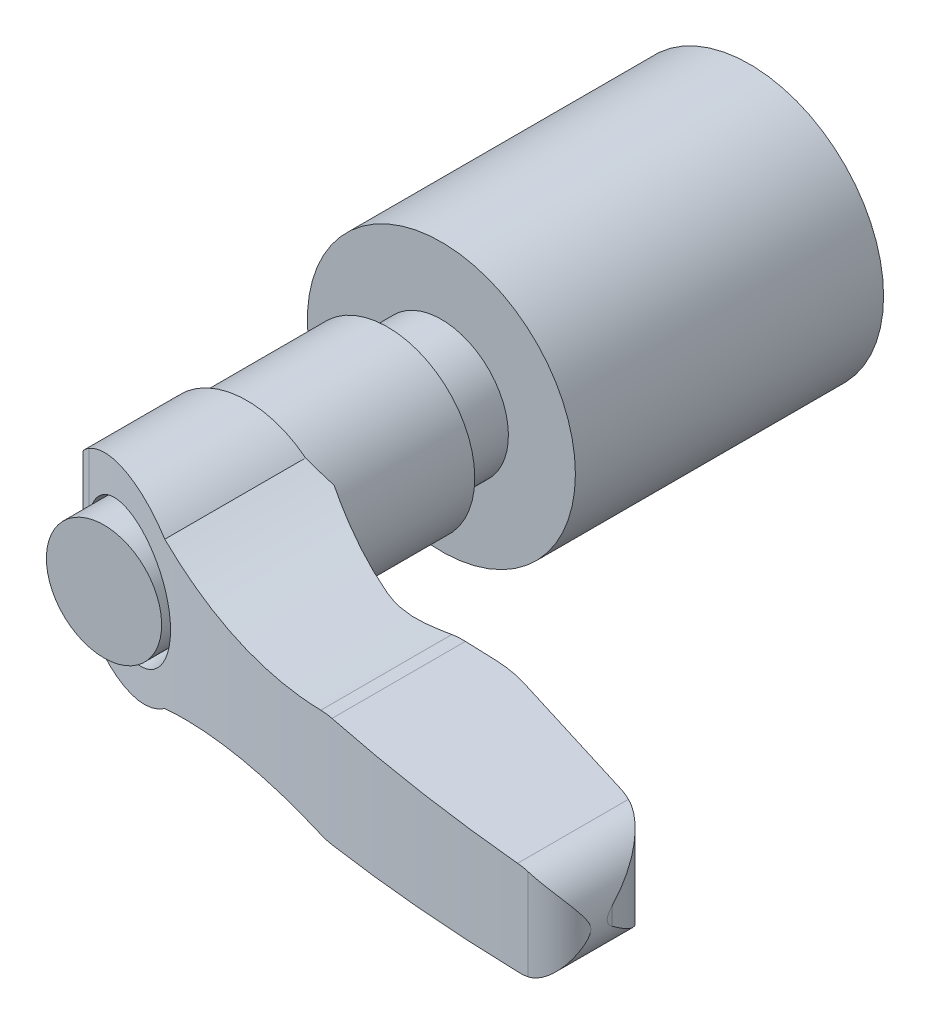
ISO-10303-21;
HEADER;
FILE_DESCRIPTION(('STEP AP214'),'2;1');
FILE_NAME('part.step','',(''),(''),'','','');
FILE_SCHEMA(('AUTOMOTIVE_DESIGN { 1 0 10303 214 1 1 1 1 }'));
ENDSEC;
DATA;
#1=APPLICATION_CONTEXT('core data for automotive mechanical design processes');
#2=APPLICATION_PROTOCOL_DEFINITION('international standard','automotive_design',2000,#1);
#3=PRODUCT_CONTEXT('',#1,'mechanical');
#4=PRODUCT('Part','Part','',(#3));
#5=PRODUCT_RELATED_PRODUCT_CATEGORY('part','',(#4));
#6=PRODUCT_DEFINITION_FORMATION('','',#4);
#7=PRODUCT_DEFINITION_CONTEXT('part definition',#1,'design');
#8=PRODUCT_DEFINITION('design','',#6,#7);
#9=PRODUCT_DEFINITION_SHAPE('','',#8);
#10=(LENGTH_UNIT() NAMED_UNIT(*) SI_UNIT(.MILLI.,.METRE.));
#11=(NAMED_UNIT(*) PLANE_ANGLE_UNIT() SI_UNIT($,.RADIAN.));
#12=(NAMED_UNIT(*) SI_UNIT($,.STERADIAN.) SOLID_ANGLE_UNIT());
#13=UNCERTAINTY_MEASURE_WITH_UNIT(LENGTH_MEASURE(1.E-05),#10,'distance_accuracy_value','');
#14=(GEOMETRIC_REPRESENTATION_CONTEXT(3) GLOBAL_UNCERTAINTY_ASSIGNED_CONTEXT((#13)) GLOBAL_UNIT_ASSIGNED_CONTEXT((#10,
#11,#12)) REPRESENTATION_CONTEXT('',''));
#15=CARTESIAN_POINT('',(0.,0.,0.));
#16=DIRECTION('',(0.,0.,1.));
#17=DIRECTION('',(1.,0.,0.));
#18=AXIS2_PLACEMENT_3D('',#15,#16,#17);
#19=CARTESIAN_POINT('',(39.938965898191,-8.,50.204249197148));
#20=DIRECTION('',(-0.989626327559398,0.,0.143665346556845));
#21=DIRECTION('',(-0.143665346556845,0.,-0.989626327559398));
#22=AXIS2_PLACEMENT_3D('',#19,#20,#21);
#23=PLANE('',#22);
#24=CARTESIAN_POINT('',(36.5,0.,26.5152297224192));
#25=DIRECTION('',(-0.989626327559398,0.,0.143665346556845));
#26=DIRECTION('',(0.143665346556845,0.,0.989626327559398));
#27=AXIS2_PLACEMENT_3D('',#24,#25,#26);
#28=ELLIPSE('',#27,24.3621728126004,3.5);
#29=CARTESIAN_POINT('',(39.938965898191,-0.650779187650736,50.204249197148));
#30=VERTEX_POINT('',#29);
#31=CARTESIAN_POINT('',(39.938965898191,0.650779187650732,50.204249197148));
#32=VERTEX_POINT('',#31);
#33=EDGE_CURVE('E355',#30,#32,#28,.T.);
#34=ORIENTED_EDGE('',*,*,#33,.F.);
#35=DIRECTION('',(0.,1.,0.));
#36=VECTOR('',#35,1.);
#37=CARTESIAN_POINT('',(39.938965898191,-8.,50.204249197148));
#38=LINE('',#37,#36);
#39=EDGE_CURVE('E184',#30,#32,#38,.T.);
#40=ORIENTED_EDGE('',*,*,#39,.T.);
#41=EDGE_LOOP('',(#34,#40));
#42=FACE_BOUND('',#41,.T.);
#43=ADVANCED_FACE('F14',(#42),#23,.F.);
#44=CARTESIAN_POINT('',(33.8626602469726,-8.,51.0863544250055));
#45=DIRECTION('',(0.,1.,0.));
#46=DIRECTION('',(-1.,0.,0.));
#47=AXIS2_PLACEMENT_3D('',#44,#45,#46);
#48=CYLINDRICAL_SURFACE('',#47,6.14000000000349);
#49=CARTESIAN_POINT('',(33.8626602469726,3.59762871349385,51.0863544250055));
#50=DIRECTION('',(0.0369925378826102,0.999315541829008,0.));
#51=DIRECTION('',(-0.999315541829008,0.0369925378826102,0.));
#52=AXIS2_PLACEMENT_3D('',#49,#50,#51);
#53=ELLIPSE('',#52,6.14420545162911,6.14000000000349);
#54=CARTESIAN_POINT('',(36.5,3.5,45.5416236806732));
#55=VERTEX_POINT('',#54);
#56=CARTESIAN_POINT('',(35.534460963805,3.53574220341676,45.178335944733));
#57=VERTEX_POINT('',#56);
#58=EDGE_CURVE('E494',#55,#57,#53,.T.);
#59=ORIENTED_EDGE('',*,*,#58,.F.);
#60=CARTESIAN_POINT('',(39.938965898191,0.650779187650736,50.204249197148));
#61=CARTESIAN_POINT('',(39.924702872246,0.726086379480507,50.1059853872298));
#62=CARTESIAN_POINT('',(39.9079968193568,0.800887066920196,50.007686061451));
#63=CARTESIAN_POINT('',(39.8696347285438,0.949458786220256,49.8112602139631));
#64=CARTESIAN_POINT('',(39.8479781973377,1.02322971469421,49.7131337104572));
#65=CARTESIAN_POINT('',(39.7995979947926,1.16988012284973,49.5170899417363));
#66=CARTESIAN_POINT('',(39.7728626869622,1.24275713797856,49.4191736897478));
#67=CARTESIAN_POINT('',(39.7142815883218,1.38725410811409,49.2239599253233));
#68=CARTESIAN_POINT('',(39.6824358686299,1.45887408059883,49.1266624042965));
#69=CARTESIAN_POINT('',(39.5782917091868,1.67318502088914,48.8337016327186));
#70=CARTESIAN_POINT('',(39.4979263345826,1.81366367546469,48.6391889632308));
#71=CARTESIAN_POINT('',(39.3150854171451,2.08619457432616,48.2551202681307));
#72=CARTESIAN_POINT('',(39.2126344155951,2.21825596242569,48.0655590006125));
#73=CARTESIAN_POINT('',(38.9595027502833,2.49877334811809,47.6523338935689));
#74=CARTESIAN_POINT('',(38.8031801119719,2.64456339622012,47.4302018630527));
#75=CARTESIAN_POINT('',(38.5417124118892,2.84488994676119,47.108275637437));
#76=CARTESIAN_POINT('',(38.4501831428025,2.90854134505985,47.0029632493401));
#77=CARTESIAN_POINT('',(38.2579442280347,3.02861213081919,46.7967186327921));
#78=CARTESIAN_POINT('',(38.1572360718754,3.08503268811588,46.6957856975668));
#79=CARTESIAN_POINT('',(37.8892625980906,3.21757634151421,46.4457323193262));
#80=CARTESIAN_POINT('',(37.7155213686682,3.28779061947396,46.300164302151));
#81=CARTESIAN_POINT('',(37.4396992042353,3.37286339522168,46.0946053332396));
#82=CARTESIAN_POINT('',(37.345317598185,3.39783246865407,46.0282732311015));
#83=CARTESIAN_POINT('',(37.1517842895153,3.44019984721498,45.9003457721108));
#84=CARTESIAN_POINT('',(37.0526354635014,3.45760265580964,45.8387476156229));
#85=CARTESIAN_POINT('',(36.8781783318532,3.48029211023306,45.7372021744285));
#86=CARTESIAN_POINT('',(36.8038676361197,3.48759914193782,45.6959814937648));
#87=CARTESIAN_POINT('',(36.6533047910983,3.49745586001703,45.6165121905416));
#88=CARTESIAN_POINT('',(36.5770513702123,3.50000234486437,45.57826558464));
#89=CARTESIAN_POINT('',(36.5,3.5,45.5416236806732));
#90=B_SPLINE_CURVE_WITH_KNOTS('',3,(#60,#61,#62,#63,#64,#65,#66,#67,#68,#69,#70,#71,#72,#73,#74,
#75,#76,#77,#78,#79,#80,#81,#82,#83,#84,#85,#86,#87,#88,#89),.UNSPECIFIED.,.F.,.F.,(4,2,2,2,2,2,
2,2,2,2,2,2,2,2,4),(0.,0.373839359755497,0.747715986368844,1.12245980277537,1.49719840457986,
2.25512351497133,3.01221072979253,3.93367725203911,4.39332639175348,4.85290107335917,
5.56171222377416,5.91546495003,6.26900683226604,6.52468766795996,6.78054039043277),.UNSPECIFIED.);
#91=EDGE_CURVE('E354',#32,#55,#90,.T.);
#92=ORIENTED_EDGE('',*,*,#91,.F.);
#93=ORIENTED_EDGE('',*,*,#39,.F.);
#94=CARTESIAN_POINT('',(36.5,-3.5,45.5416236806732));
#95=CARTESIAN_POINT('',(36.6061539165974,-3.50000941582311,45.5920863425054));
#96=CARTESIAN_POINT('',(36.7107657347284,-3.49517280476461,45.6456099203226));
#97=CARTESIAN_POINT('',(36.9160027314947,-3.47671082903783,45.7581011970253));
#98=CARTESIAN_POINT('',(37.016634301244,-3.46310021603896,45.8170596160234));
#99=CARTESIAN_POINT('',(37.212347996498,-3.42816986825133,45.9392782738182));
#100=CARTESIAN_POINT('',(37.3074768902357,-3.40693163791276,46.0024874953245));
#101=CARTESIAN_POINT('',(37.4929223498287,-3.35757592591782,46.1332068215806));
#102=CARTESIAN_POINT('',(37.5832363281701,-3.32945478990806,46.2007191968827));
#103=CARTESIAN_POINT('',(37.7830795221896,-3.2585052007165,46.358740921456));
#104=CARTESIAN_POINT('',(37.890992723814,-3.21376078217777,46.4504360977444));
#105=CARTESIAN_POINT('',(38.0982482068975,-3.11588681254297,46.6389903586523));
#106=CARTESIAN_POINT('',(38.1975840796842,-3.06275107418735,46.7358532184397));
#107=CARTESIAN_POINT('',(38.3880468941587,-2.94917464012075,46.934309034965));
#108=CARTESIAN_POINT('',(38.479132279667,-2.88870020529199,47.035922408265));
#109=CARTESIAN_POINT('',(38.6526412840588,-2.76182607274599,47.2426721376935));
#110=CARTESIAN_POINT('',(38.7350674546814,-2.69542813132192,47.3478074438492));
#111=CARTESIAN_POINT('',(38.9229341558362,-2.52996933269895,47.6038856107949));
#112=CARTESIAN_POINT('',(39.0243159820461,-2.42850340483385,47.7562617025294));
#113=CARTESIAN_POINT('',(39.2111706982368,-2.21796613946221,48.0654781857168));
#114=CARTESIAN_POINT('',(39.2966363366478,-2.10889136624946,48.2223205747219));
#115=CARTESIAN_POINT('',(39.4522229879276,-1.88493092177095,48.5392893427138));
#116=CARTESIAN_POINT('',(39.5223498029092,-1.77004746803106,48.699414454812));
#117=CARTESIAN_POINT('',(39.6478320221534,-1.53583460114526,49.0220530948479));
#118=CARTESIAN_POINT('',(39.7031929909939,-1.41650688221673,49.1845656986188));
#119=CARTESIAN_POINT('',(39.7933776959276,-1.19018579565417,49.4900634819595));
#120=CARTESIAN_POINT('',(39.8299343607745,-1.08360162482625,49.6328455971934));
#121=CARTESIAN_POINT('',(39.8923391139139,-0.868586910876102,49.9185049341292));
#122=CARTESIAN_POINT('',(39.9182264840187,-0.760164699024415,50.0613798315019));
#123=CARTESIAN_POINT('',(39.938965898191,-0.650779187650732,50.204249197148));
#124=B_SPLINE_CURVE_WITH_KNOTS('',3,(#94,#95,#96,#97,#98,#99,#100,#101,#102,#103,#104,#105,#106,
#107,#108,#109,#110,#111,#112,#113,#114,#115,#116,#117,#118,#119,#120,#121,#122,#123),
.UNSPECIFIED.,.F.,.F.,(4,2,2,2,2,2,2,2,2,2,2,2,2,2,4),(0.,0.352350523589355,0.704110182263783,
1.05221781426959,1.40051067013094,1.8453815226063,2.29058194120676,2.73791274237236,
3.185111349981,3.81198117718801,4.43913591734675,5.06605301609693,5.69273352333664,
6.23807905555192,6.78139842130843),.UNSPECIFIED.);
#125=CARTESIAN_POINT('',(36.5,-3.5,45.5416236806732));
#126=VERTEX_POINT('',#125);
#127=EDGE_CURVE('E348',#126,#30,#124,.T.);
#128=ORIENTED_EDGE('',*,*,#127,.F.);
#129=CARTESIAN_POINT('',(33.8626602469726,-3.59762871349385,51.0863544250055));
#130=DIRECTION('',(0.0369925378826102,-0.999315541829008,0.));
#131=DIRECTION('',(0.999315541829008,0.0369925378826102,0.));
#132=AXIS2_PLACEMENT_3D('',#129,#130,#131);
#133=ELLIPSE('',#132,6.14420545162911,6.14000000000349);
#134=CARTESIAN_POINT('',(35.534460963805,-3.53574220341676,45.178335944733));
#135=VERTEX_POINT('',#134);
#136=EDGE_CURVE('E527',#135,#126,#133,.T.);
#137=ORIENTED_EDGE('',*,*,#136,.F.);
#138=DIRECTION('',(0.,1.,0.));
#139=VECTOR('',#138,1.);
#140=CARTESIAN_POINT('',(35.534460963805,-8.,45.178335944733));
#141=LINE('',#140,#139);
#142=EDGE_CURVE('E192',#135,#57,#141,.T.);
#143=ORIENTED_EDGE('',*,*,#142,.T.);
#144=EDGE_LOOP('',(#59,#92,#93,#128,#137,#143));
#145=FACE_BOUND('',#144,.T.);
#146=ADVANCED_FACE('F361',(#145),#48,.T.);
#147=CARTESIAN_POINT('',(25.51080482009,-8.,42.34192715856));
#148=DIRECTION('',(-0.272280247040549,0.,0.962217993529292));
#149=DIRECTION('',(-0.962217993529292,0.,-0.272280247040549));
#150=AXIS2_PLACEMENT_3D('',#147,#148,#149);
#151=PLANE('',#150);
#152=DIRECTION('',(-0.961608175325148,0.0355966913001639,-0.272107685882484));
#153=VECTOR('',#152,1.);
#154=CARTESIAN_POINT('',(25.918375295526,3.8917092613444,42.4572579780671));
#155=LINE('',#154,#153);
#156=CARTESIAN_POINT('',(25.51080482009,3.90679665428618,42.34192715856));
#157=VERTEX_POINT('',#156);
#158=EDGE_CURVE('E497',#57,#157,#155,.T.);
#159=ORIENTED_EDGE('',*,*,#158,.F.);
#160=ORIENTED_EDGE('',*,*,#142,.F.);
#161=DIRECTION('',(0.961608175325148,0.0355966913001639,0.272107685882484));
#162=VECTOR('',#161,1.);
#163=CARTESIAN_POINT('',(25.3706941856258,-3.9119832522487,42.3022798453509));
#164=LINE('',#163,#162);
#165=CARTESIAN_POINT('',(25.51080482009,-3.90679665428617,42.34192715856));
#166=VERTEX_POINT('',#165);
#167=EDGE_CURVE('E535',#166,#135,#164,.T.);
#168=ORIENTED_EDGE('',*,*,#167,.F.);
#169=DIRECTION('',(0.,1.,0.));
#170=VECTOR('',#169,1.);
#171=CARTESIAN_POINT('',(25.51080482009,-8.,42.34192715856));
#172=LINE('',#171,#170);
#173=EDGE_CURVE('E195',#166,#157,#172,.T.);
#174=ORIENTED_EDGE('',*,*,#173,.T.);
#175=EDGE_LOOP('',(#159,#160,#168,#174));
#176=FACE_BOUND('',#175,.T.);
#177=ADVANCED_FACE('F365',(#176),#151,.F.);
#178=CARTESIAN_POINT('',(23.0466685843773,-8.,51.0499999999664));
#179=DIRECTION('',(0.,1.,0.));
#180=DIRECTION('',(-1.,0.,0.));
#181=AXIS2_PLACEMENT_3D('',#178,#179,#180);
#182=CYLINDRICAL_SURFACE('',#181,9.04999999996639);
#183=CARTESIAN_POINT('',(23.0466685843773,3.99801374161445,51.0499999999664));
#184=DIRECTION('',(0.0369925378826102,0.999315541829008,0.));
#185=DIRECTION('',(-0.999315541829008,0.0369925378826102,0.));
#186=AXIS2_PLACEMENT_3D('',#183,#184,#185);
#187=ELLIPSE('',#186,9.05619858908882,9.04999999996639);
#188=CARTESIAN_POINT('',(23.046668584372,3.99801374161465,42.));
#189=VERTEX_POINT('',#188);
#190=EDGE_CURVE('E500',#157,#189,#187,.T.);
#191=ORIENTED_EDGE('',*,*,#190,.F.);
#192=ORIENTED_EDGE('',*,*,#173,.F.);
#193=CARTESIAN_POINT('',(23.0466685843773,-3.99801374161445,51.0499999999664));
#194=DIRECTION('',(0.0369925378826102,-0.999315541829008,0.));
#195=DIRECTION('',(0.999315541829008,0.0369925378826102,0.));
#196=AXIS2_PLACEMENT_3D('',#193,#194,#195);
#197=ELLIPSE('',#196,9.05619858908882,9.04999999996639);
#198=CARTESIAN_POINT('',(23.046668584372,-3.99801374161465,42.));
#199=VERTEX_POINT('',#198);
#200=EDGE_CURVE('E537',#199,#166,#197,.T.);
#201=ORIENTED_EDGE('',*,*,#200,.F.);
#202=DIRECTION('',(0.,1.,0.));
#203=VECTOR('',#202,1.);
#204=CARTESIAN_POINT('',(23.046668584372,-8.,42.));
#205=LINE('',#204,#203);
#206=EDGE_CURVE('E198',#199,#189,#205,.T.);
#207=ORIENTED_EDGE('',*,*,#206,.T.);
#208=EDGE_LOOP('',(#191,#192,#201,#207));
#209=FACE_BOUND('',#208,.T.);
#210=ADVANCED_FACE('F370',(#209),#182,.T.);
#211=CARTESIAN_POINT('',(17.750423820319,-8.,42.));
#212=DIRECTION('',(0.,0.,1.));
#213=DIRECTION('',(0.,-1.,0.));
#214=AXIS2_PLACEMENT_3D('',#211,#212,#213);
#215=PLANE('',#214);
#216=CARTESIAN_POINT('',(14.8,33.6,42.));
#217=DIRECTION('',(0.,0.,1.));
#218=DIRECTION('',(0.,-1.,0.));
#219=AXIS2_PLACEMENT_3D('',#216,#217,#218);
#220=CIRCLE('',#219,30.);
#221=CARTESIAN_POINT('',(19.776621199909,4.0156588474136,42.));
#222=VERTEX_POINT('',#221);
#223=CARTESIAN_POINT('',(17.750423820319,3.74543587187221,42.));
#224=VERTEX_POINT('',#223);
#225=EDGE_CURVE('E405',#222,#224,#220,.F.);
#226=ORIENTED_EDGE('',*,*,#225,.F.);
#227=CARTESIAN_POINT('',(20.6060580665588,-0.915064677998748,42.));
#228=DIRECTION('',(0.,0.,1.));
#229=DIRECTION('',(0.,-1.,0.));
#230=AXIS2_PLACEMENT_3D('',#227,#228,#229);
#231=CIRCLE('',#230,4.99999999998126);
#232=CARTESIAN_POINT('',(20.791020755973,4.0815130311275,42.));
#233=VERTEX_POINT('',#232);
#234=EDGE_CURVE('E505',#233,#222,#231,.T.);
#235=ORIENTED_EDGE('',*,*,#234,.F.);
#236=DIRECTION('',(-0.999315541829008,0.0369925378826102,0.));
#237=VECTOR('',#236,1.);
#238=CARTESIAN_POINT('',(18.2012046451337,4.17738252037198,42.));
#239=LINE('',#238,#237);
#240=EDGE_CURVE('E504',#189,#233,#239,.T.);
#241=ORIENTED_EDGE('',*,*,#240,.F.);
#242=ORIENTED_EDGE('',*,*,#206,.F.);
#243=DIRECTION('',(0.999315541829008,0.0369925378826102,0.));
#244=VECTOR('',#243,1.);
#245=CARTESIAN_POINT('',(17.6097291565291,-4.19927768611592,42.));
#246=LINE('',#245,#244);
#247=CARTESIAN_POINT('',(20.791020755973,-4.0815130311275,42.));
#248=VERTEX_POINT('',#247);
#249=EDGE_CURVE('E538',#248,#199,#246,.T.);
#250=ORIENTED_EDGE('',*,*,#249,.F.);
#251=CARTESIAN_POINT('',(20.6060580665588,0.915064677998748,42.));
#252=DIRECTION('',(0.,0.,1.));
#253=DIRECTION('',(0.,-1.,0.));
#254=AXIS2_PLACEMENT_3D('',#251,#252,#253);
#255=CIRCLE('',#254,4.99999999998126);
#256=CARTESIAN_POINT('',(19.776621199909,-4.01565884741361,42.));
#257=VERTEX_POINT('',#256);
#258=EDGE_CURVE('E519',#257,#248,#255,.T.);
#259=ORIENTED_EDGE('',*,*,#258,.F.);
#260=CARTESIAN_POINT('',(14.8,-33.6,42.));
#261=DIRECTION('',(0.,0.,1.));
#262=DIRECTION('',(0.,-1.,0.));
#263=AXIS2_PLACEMENT_3D('',#260,#261,#262);
#264=CIRCLE('',#263,30.);
#265=CARTESIAN_POINT('',(17.750423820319,-3.74543587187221,42.));
#266=VERTEX_POINT('',#265);
#267=EDGE_CURVE('E517',#266,#257,#264,.F.);
#268=ORIENTED_EDGE('',*,*,#267,.F.);
#269=DIRECTION('',(0.,1.,0.));
#270=VECTOR('',#269,1.);
#271=CARTESIAN_POINT('',(17.750423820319,-8.,42.));
#272=LINE('',#271,#270);
#273=EDGE_CURVE('E201',#266,#224,#272,.T.);
#274=ORIENTED_EDGE('',*,*,#273,.T.);
#275=EDGE_LOOP('',(#226,#235,#241,#242,#250,#259,#268,#274));
#276=FACE_BOUND('',#275,.T.);
#277=ADVANCED_FACE('F374',(#276),#215,.F.);
#278=CARTESIAN_POINT('',(17.7504238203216,-8.,32.9499999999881));
#279=DIRECTION('',(0.,1.,0.));
#280=DIRECTION('',(-1.,0.,0.));
#281=AXIS2_PLACEMENT_3D('',#278,#279,#280);
#282=CYLINDRICAL_SURFACE('',#281,9.05000000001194);
#283=CARTESIAN_POINT('',(17.750423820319,3.74543587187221,42.));
#284=CARTESIAN_POINT('',(17.5046390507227,3.72111558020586,42.0000347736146));
#285=CARTESIAN_POINT('',(17.2585407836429,3.69988852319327,41.9899888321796));
#286=CARTESIAN_POINT('',(16.7673975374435,3.66357523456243,41.9498183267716));
#287=CARTESIAN_POINT('',(16.5223532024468,3.6484923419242,41.9196828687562));
#288=CARTESIAN_POINT('',(16.0394135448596,3.62465265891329,41.8400993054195));
#289=CARTESIAN_POINT('',(15.8014675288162,3.61579257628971,41.7909886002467));
#290=CARTESIAN_POINT('',(15.3302904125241,3.60376296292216,41.673778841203));
#291=CARTESIAN_POINT('',(15.0970562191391,3.60058957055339,41.6056927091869));
#292=CARTESIAN_POINT('',(14.7640124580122,3.59984438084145,41.4937500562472));
#293=CARTESIAN_POINT('',(14.6616681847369,3.60014663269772,41.4572847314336));
#294=CARTESIAN_POINT('',(14.4579719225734,3.60177627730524,41.3805483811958));
#295=CARTESIAN_POINT('',(14.3566253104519,3.60310763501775,41.340263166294));
#296=CARTESIAN_POINT('',(14.2560355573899,3.60493202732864,41.2981585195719));
#297=B_SPLINE_CURVE_WITH_KNOTS('',3,(#283,#284,#285,#286,#287,#288,#289,#290,#291,#292,#293,
#294,#295,#296),.UNSPECIFIED.,.F.,.F.,(4,2,2,2,2,2,4),(0.,0.740745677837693,1.48189337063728,
2.21042785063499,2.93846742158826,3.26434594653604,3.59148632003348),.UNSPECIFIED.);
#298=CARTESIAN_POINT('',(14.2560355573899,3.60493202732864,41.2981585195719));
#299=VERTEX_POINT('',#298);
#300=EDGE_CURVE('E397',#224,#299,#297,.T.);
#301=ORIENTED_EDGE('',*,*,#300,.F.);
#302=ORIENTED_EDGE('',*,*,#273,.F.);
#303=CARTESIAN_POINT('',(14.2560355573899,-3.60493202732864,41.2981585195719));
#304=CARTESIAN_POINT('',(14.483816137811,-3.60077563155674,41.3935396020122));
#305=CARTESIAN_POINT('',(14.7155749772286,-3.59919241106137,41.4795580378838));
#306=CARTESIAN_POINT('',(15.1854578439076,-3.60156277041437,41.6324166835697));
#307=CARTESIAN_POINT('',(15.423585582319,-3.60551965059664,41.6992454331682));
#308=CARTESIAN_POINT('',(15.9002362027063,-3.61924836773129,41.8121846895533));
#309=CARTESIAN_POINT('',(16.1386829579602,-3.62891979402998,41.8586293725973));
#310=CARTESIAN_POINT('',(16.6180975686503,-3.65418161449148,41.9321530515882));
#311=CARTESIAN_POINT('',(16.85906355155,-3.6697678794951,41.9592455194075));
#312=CARTESIAN_POINT('',(17.2084780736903,-3.69663888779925,41.9844088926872));
#313=CARTESIAN_POINT('',(17.316603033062,-3.70554405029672,41.9902441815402));
#314=CARTESIAN_POINT('',(17.5333084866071,-3.72457700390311,41.9980471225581));
#315=CARTESIAN_POINT('',(17.6418891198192,-3.73470940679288,41.9999996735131));
#316=CARTESIAN_POINT('',(17.750423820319,-3.74543587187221,42.));
#317=B_SPLINE_CURVE_WITH_KNOTS('',3,(#303,#304,#305,#306,#307,#308,#309,#310,#311,#312,#313,
#314,#315,#316),.UNSPECIFIED.,.F.,.F.,(4,2,2,2,2,2,4),(0.,0.740736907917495,1.48191527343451,
2.21044217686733,2.93846142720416,3.26434207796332,3.59148772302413),.UNSPECIFIED.);
#318=CARTESIAN_POINT('',(14.2560355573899,-3.60493202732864,41.2981585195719));
#319=VERTEX_POINT('',#318);
#320=EDGE_CURVE('E389',#319,#266,#317,.T.);
#321=ORIENTED_EDGE('',*,*,#320,.F.);
#322=DIRECTION('',(0.,1.,0.));
#323=VECTOR('',#322,1.);
#324=CARTESIAN_POINT('',(14.2560355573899,-8.,41.2981585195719));
#325=LINE('',#324,#323);
#326=EDGE_CURVE('E204',#319,#299,#325,.T.);
#327=ORIENTED_EDGE('',*,*,#326,.T.);
#328=EDGE_LOOP('',(#301,#302,#321,#327));
#329=FACE_BOUND('',#328,.T.);
#330=ADVANCED_FACE('F378',(#329),#282,.F.);
#331=CARTESIAN_POINT('',(42.8289340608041,-8.,-26.9630271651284));
#332=DIRECTION('',(0.,1.,0.));
#333=DIRECTION('',(-1.,0.,0.));
#334=AXIS2_PLACEMENT_3D('',#331,#332,#333);
#335=CYLINDRICAL_SURFACE('',#334,73.9999999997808);
#336=ORIENTED_EDGE('',*,*,#326,.F.);
#337=CARTESIAN_POINT('',(6.49,-4.77390244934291,37.5));
#338=CARTESIAN_POINT('',(7.10709183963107,-4.59600017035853,37.8479114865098));
#339=CARTESIAN_POINT('',(7.73340291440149,-4.43691869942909,38.1892512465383));
#340=CARTESIAN_POINT('',(8.9999083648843,-4.15891482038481,38.8557045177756));
#341=CARTESIAN_POINT('',(9.64003521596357,-4.03983028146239,39.1808788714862));
#342=CARTESIAN_POINT('',(10.9347595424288,-3.84283944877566,39.814824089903));
#343=CARTESIAN_POINT('',(11.5893580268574,-3.76493603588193,40.1235938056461));
#344=CARTESIAN_POINT('',(12.5814258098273,-3.68029491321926,40.5737847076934));
#345=CARTESIAN_POINT('',(12.9145226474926,-3.65743626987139,40.7219861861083));
#346=CARTESIAN_POINT('',(13.583370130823,-3.62280963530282,41.0136612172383));
#347=CARTESIAN_POINT('',(13.9191209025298,-3.6110421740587,41.1571345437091));
#348=CARTESIAN_POINT('',(14.2560355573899,-3.60493202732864,41.298158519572));
#349=B_SPLINE_CURVE_WITH_KNOTS('',3,(#337,#338,#339,#340,#341,#342,#343,#344,#345,#346,#347,
#348),.UNSPECIFIED.,.F.,.F.,(4,2,2,2,2,4),(0.,2.19098662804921,4.37298159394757,
6.55512918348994,7.6508296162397,8.74658240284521),.UNSPECIFIED.);
#350=CARTESIAN_POINT('',(6.49,-4.77390244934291,37.5));
#351=VERTEX_POINT('',#350);
#352=EDGE_CURVE('E520',#351,#319,#349,.T.);
#353=ORIENTED_EDGE('',*,*,#352,.F.);
#354=DIRECTION('',(0.,1.,0.));
#355=VECTOR('',#354,1.);
#356=CARTESIAN_POINT('',(6.49,-8.,37.5));
#357=LINE('',#356,#355);
#358=CARTESIAN_POINT('',(6.49,0.,37.5));
#359=VERTEX_POINT('',#358);
#360=EDGE_CURVE('E208',#351,#359,#357,.T.);
#361=ORIENTED_EDGE('',*,*,#360,.T.);
#362=CARTESIAN_POINT('',(6.49,4.77390244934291,37.5));
#363=VERTEX_POINT('',#362);
#364=EDGE_CURVE('E207',#359,#363,#357,.T.);
#365=ORIENTED_EDGE('',*,*,#364,.T.);
#366=CARTESIAN_POINT('',(14.2560355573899,3.60493202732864,41.2981585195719));
#367=CARTESIAN_POINT('',(13.9191209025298,3.6110421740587,41.157134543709));
#368=CARTESIAN_POINT('',(13.583370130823,3.62280963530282,41.0136612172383));
#369=CARTESIAN_POINT('',(12.9145226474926,3.65743626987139,40.7219861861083));
#370=CARTESIAN_POINT('',(12.5814258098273,3.68029491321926,40.5737847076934));
#371=CARTESIAN_POINT('',(11.5893580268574,3.76493603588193,40.1235938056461));
#372=CARTESIAN_POINT('',(10.9347595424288,3.84283944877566,39.814824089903));
#373=CARTESIAN_POINT('',(9.64003521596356,4.03983028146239,39.1808788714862));
#374=CARTESIAN_POINT('',(8.99990836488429,4.15891482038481,38.8557045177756));
#375=CARTESIAN_POINT('',(7.73340291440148,4.43691869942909,38.1892512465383));
#376=CARTESIAN_POINT('',(7.10709183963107,4.59600017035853,37.8479114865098));
#377=CARTESIAN_POINT('',(6.49,4.77390244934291,37.5));
#378=B_SPLINE_CURVE_WITH_KNOTS('',3,(#366,#367,#368,#369,#370,#371,#372,#373,#374,#375,#376,
#377),.UNSPECIFIED.,.F.,.F.,(4,2,2,2,2,4),(0.,1.09575278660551,2.19145321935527,
4.37360080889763,6.55559577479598,8.74658240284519),.UNSPECIFIED.);
#379=EDGE_CURVE('E404',#299,#363,#378,.T.);
#380=ORIENTED_EDGE('',*,*,#379,.F.);
#381=EDGE_LOOP('',(#336,#353,#361,#365,#380));
#382=FACE_BOUND('',#381,.T.);
#383=ADVANCED_FACE('F383',(#382),#335,.F.);
#384=CARTESIAN_POINT('',(-6.51,-8.,37.5));
#385=DIRECTION('',(0.,0.,1.));
#386=DIRECTION('',(0.,-1.,0.));
#387=AXIS2_PLACEMENT_3D('',#384,#385,#386);
#388=PLANE('',#387);
#389=CARTESIAN_POINT('',(14.8,-33.6,37.5));
#390=DIRECTION('',(0.,0.,1.));
#391=DIRECTION('',(0.,-1.,0.));
#392=AXIS2_PLACEMENT_3D('',#389,#390,#391);
#393=CIRCLE('',#392,30.);
#394=CARTESIAN_POINT('',(4.3627858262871,-5.4741300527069,37.5));
#395=VERTEX_POINT('',#394);
#396=EDGE_CURVE('E522',#395,#351,#393,.F.);
#397=ORIENTED_EDGE('',*,*,#396,.F.);
#398=CARTESIAN_POINT('',(0.,0.,37.5));
#399=DIRECTION('',(0.,0.,1.));
#400=DIRECTION('',(0.,-1.,0.));
#401=AXIS2_PLACEMENT_3D('',#398,#399,#400);
#402=CIRCLE('',#401,7.);
#403=CARTESIAN_POINT('',(-6.51,-2.57291663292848,37.5));
#404=VERTEX_POINT('',#403);
#405=EDGE_CURVE('E461',#404,#395,#402,.T.);
#406=ORIENTED_EDGE('',*,*,#405,.F.);
#407=DIRECTION('',(0.,1.,0.));
#408=VECTOR('',#407,1.);
#409=CARTESIAN_POINT('',(-6.51,-8.,37.5));
#410=LINE('',#409,#408);
#411=CARTESIAN_POINT('',(-6.51,0.,37.5));
#412=VERTEX_POINT('',#411);
#413=EDGE_CURVE('E211',#404,#412,#410,.T.);
#414=ORIENTED_EDGE('',*,*,#413,.T.);
#415=CARTESIAN_POINT('',(-0.0099999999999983,0.,37.5));
#416=DIRECTION('',(0.,0.,1.));
#417=DIRECTION('',(0.,-1.,0.));
#418=AXIS2_PLACEMENT_3D('',#415,#416,#417);
#419=CIRCLE('',#418,6.5);
#420=EDGE_CURVE('E414',#412,#359,#419,.T.);
#421=ORIENTED_EDGE('',*,*,#420,.T.);
#422=ORIENTED_EDGE('',*,*,#360,.F.);
#423=EDGE_LOOP('',(#397,#406,#414,#421,#422));
#424=FACE_BOUND('',#423,.T.);
#425=ADVANCED_FACE('F468',(#424),#388,.F.);
#426=CARTESIAN_POINT('',(14.8,33.6,37.5));
#427=DIRECTION('',(0.,0.,1.));
#428=DIRECTION('',(0.,-1.,0.));
#429=AXIS2_PLACEMENT_3D('',#426,#427,#428);
#430=CIRCLE('',#429,30.);
#431=CARTESIAN_POINT('',(4.3627858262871,5.4741300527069,37.5));
#432=VERTEX_POINT('',#431);
#433=EDGE_CURVE('E412',#363,#432,#430,.F.);
#434=ORIENTED_EDGE('',*,*,#433,.F.);
#435=ORIENTED_EDGE('',*,*,#364,.F.);
#436=EDGE_CURVE('E416',#359,#412,#419,.T.);
#437=ORIENTED_EDGE('',*,*,#436,.T.);
#438=CARTESIAN_POINT('',(-6.51,2.57291663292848,37.5));
#439=VERTEX_POINT('',#438);
#440=EDGE_CURVE('E210',#412,#439,#410,.T.);
#441=ORIENTED_EDGE('',*,*,#440,.T.);
#442=CARTESIAN_POINT('',(0.,0.,37.5));
#443=DIRECTION('',(0.,0.,1.));
#444=DIRECTION('',(0.,-1.,0.));
#445=AXIS2_PLACEMENT_3D('',#442,#443,#444);
#446=CIRCLE('',#445,7.);
#447=EDGE_CURVE('E460',#432,#439,#446,.T.);
#448=ORIENTED_EDGE('',*,*,#447,.F.);
#449=EDGE_LOOP('',(#434,#435,#437,#441,#448));
#450=FACE_BOUND('',#449,.T.);
#451=ADVANCED_FACE('F465',(#450),#388,.F.);
#452=CARTESIAN_POINT('',(14.8,33.6,23.));
#453=DIRECTION('',(0.,0.,1.));
#454=DIRECTION('',(0.,-1.,0.));
#455=AXIS2_PLACEMENT_3D('',#452,#453,#454);
#456=CYLINDRICAL_SURFACE('',#455,30.);
#457=ORIENTED_EDGE('',*,*,#433,.T.);
#458=DIRECTION('',(0.,0.,1.));
#459=VECTOR('',#458,1.);
#460=CARTESIAN_POINT('',(4.3627858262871,5.4741300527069,23.));
#461=LINE('',#460,#459);
#462=CARTESIAN_POINT('',(4.3627858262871,5.4741300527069,48.0085693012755));
#463=VERTEX_POINT('',#462);
#464=EDGE_CURVE('E463',#432,#463,#461,.T.);
#465=ORIENTED_EDGE('',*,*,#464,.T.);
#466=CARTESIAN_POINT('',(4.36278582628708,5.47413005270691,48.0085693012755));
#467=CARTESIAN_POINT('',(4.76153276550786,5.32616217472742,48.1305821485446));
#468=CARTESIAN_POINT('',(5.16363009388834,5.18659412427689,48.2516463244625));
#469=CARTESIAN_POINT('',(5.97401057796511,4.92451651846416,48.4915739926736));
#470=CARTESIAN_POINT('',(6.38229396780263,4.80200761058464,48.6104374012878));
#471=CARTESIAN_POINT('',(7.61587459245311,4.46039912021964,48.9633347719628));
#472=CARTESIAN_POINT('',(8.44964003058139,4.2673151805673,49.1935954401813));
#473=CARTESIAN_POINT('',(10.1156680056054,3.95611406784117,49.636662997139));
#474=CARTESIAN_POINT('',(10.9475779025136,3.83647524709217,49.8497386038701));
#475=CARTESIAN_POINT('',(12.6216846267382,3.66737574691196,50.2617982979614));
#476=CARTESIAN_POINT('',(13.4638761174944,3.61788010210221,50.460789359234));
#477=CARTESIAN_POINT('',(14.7611760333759,3.5966016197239,50.7544685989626));
#478=CARTESIAN_POINT('',(15.2147501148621,3.59943074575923,50.8547479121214));
#479=CARTESIAN_POINT('',(16.1222596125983,3.62571788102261,51.0506078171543));
#480=CARTESIAN_POINT('',(16.5761949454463,3.64917203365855,51.1461892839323));
#481=CARTESIAN_POINT('',(17.4888250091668,3.71719507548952,51.3335810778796));
#482=CARTESIAN_POINT('',(17.9475132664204,3.76200786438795,51.425334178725));
#483=CARTESIAN_POINT('',(18.8634404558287,3.87288367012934,51.6037588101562));
#484=CARTESIAN_POINT('',(19.3206789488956,3.93895260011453,51.6904289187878));
#485=CARTESIAN_POINT('',(19.776621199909,4.01565884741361,51.7744790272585));
#486=B_SPLINE_CURVE_WITH_KNOTS('',3,(#466,#467,#468,#469,#470,#471,#472,#473,#474,#475,#476,
#477,#478,#479,#480,#481,#482,#483,#484,#485),.UNSPECIFIED.,.F.,.F.,(4,2,2,2,2,2,2,2,2,4),(0.,
1.32721529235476,2.65448094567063,5.3098828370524,7.90822882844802,10.5052791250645,
11.8984814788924,13.2914233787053,14.7006672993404,16.1103035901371),.UNSPECIFIED.);
#487=CARTESIAN_POINT('',(19.776621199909,4.0156588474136,51.7744790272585));
#488=VERTEX_POINT('',#487);
#489=EDGE_CURVE('E301',#463,#488,#486,.T.);
#490=ORIENTED_EDGE('',*,*,#489,.T.);
#491=DIRECTION('',(0.,0.,1.));
#492=VECTOR('',#491,1.);
#493=CARTESIAN_POINT('',(19.776621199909,4.0156588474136,23.));
#494=LINE('',#493,#492);
#495=EDGE_CURVE('E257',#222,#488,#494,.T.);
#496=ORIENTED_EDGE('',*,*,#495,.F.);
#497=ORIENTED_EDGE('',*,*,#225,.T.);
#498=ORIENTED_EDGE('',*,*,#300,.T.);
#499=ORIENTED_EDGE('',*,*,#379,.T.);
#500=EDGE_LOOP('',(#457,#465,#490,#496,#497,#498,#499));
#501=FACE_BOUND('',#500,.T.);
#502=ADVANCED_FACE('F239',(#501),#456,.F.);
#503=CARTESIAN_POINT('',(20.6060580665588,-0.915064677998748,23.));
#504=DIRECTION('',(0.,0.,1.));
#505=DIRECTION('',(0.,-1.,0.));
#506=AXIS2_PLACEMENT_3D('',#503,#504,#505);
#507=CYLINDRICAL_SURFACE('',#506,4.99999999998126);
#508=ORIENTED_EDGE('',*,*,#234,.T.);
#509=ORIENTED_EDGE('',*,*,#495,.T.);
#510=CARTESIAN_POINT('',(19.776621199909,4.0156588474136,51.7744790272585));
#511=CARTESIAN_POINT('',(19.944491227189,4.04386032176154,51.8054315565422));
#512=CARTESIAN_POINT('',(20.1129595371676,4.06344890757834,51.8361672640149));
#513=CARTESIAN_POINT('',(20.4510927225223,4.08540030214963,51.8972050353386));
#514=CARTESIAN_POINT('',(20.6207575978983,4.08776311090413,51.9275070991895));
#515=CARTESIAN_POINT('',(20.791020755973,4.0815130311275,51.9575923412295));
#516=B_SPLINE_CURVE_WITH_KNOTS('',3,(#510,#511,#512,#513,#514,#515),.UNSPECIFIED.,.F.,.F.,(4,2,
4),(0.,0.517097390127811,1.03419478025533),.UNSPECIFIED.);
#517=CARTESIAN_POINT('',(20.791020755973,4.0815130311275,51.9575923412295));
#518=VERTEX_POINT('',#517);
#519=EDGE_CURVE('E307',#488,#518,#516,.T.);
#520=ORIENTED_EDGE('',*,*,#519,.T.);
#521=DIRECTION('',(0.,0.,1.));
#522=VECTOR('',#521,1.);
#523=CARTESIAN_POINT('',(20.791020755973,4.0815130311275,23.));
#524=LINE('',#523,#522);
#525=EDGE_CURVE('E258',#233,#518,#524,.T.);
#526=ORIENTED_EDGE('',*,*,#525,.F.);
#527=EDGE_LOOP('',(#508,#509,#520,#526));
#528=FACE_BOUND('',#527,.T.);
#529=ADVANCED_FACE('F549',(#528),#507,.T.);
#530=CARTESIAN_POINT('',(36.5,3.5,23.));
#531=DIRECTION('',(0.0369925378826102,0.999315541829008,0.));
#532=DIRECTION('',(-0.999315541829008,0.0369925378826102,0.));
#533=AXIS2_PLACEMENT_3D('',#530,#531,#532);
#534=PLANE('',#533);
#535=ORIENTED_EDGE('',*,*,#240,.T.);
#536=ORIENTED_EDGE('',*,*,#525,.T.);
#537=CARTESIAN_POINT('',(44.8871950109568,3.18952386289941,-84.430179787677));
#538=DIRECTION('',(0.0369925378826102,0.999315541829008,0.));
#539=DIRECTION('',(-0.999315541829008,0.0369925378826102,0.));
#540=AXIS2_PLACEMENT_3D('',#537,#538,#539);
#541=ELLIPSE('',#540,138.594862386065,138.500000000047);
#542=CARTESIAN_POINT('',(36.5,3.5,53.8156337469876));
#543=VERTEX_POINT('',#542);
#544=EDGE_CURVE('E319',#518,#543,#541,.T.);
#545=ORIENTED_EDGE('',*,*,#544,.T.);
#546=DIRECTION('',(0.,0.,1.));
#547=VECTOR('',#546,1.);
#548=CARTESIAN_POINT('',(36.5,3.5,23.));
#549=LINE('',#548,#547);
#550=EDGE_CURVE('E558',#55,#543,#549,.T.);
#551=ORIENTED_EDGE('',*,*,#550,.F.);
#552=ORIENTED_EDGE('',*,*,#58,.T.);
#553=ORIENTED_EDGE('',*,*,#158,.T.);
#554=ORIENTED_EDGE('',*,*,#190,.T.);
#555=EDGE_LOOP('',(#535,#536,#545,#551,#552,#553,#554));
#556=FACE_BOUND('',#555,.T.);
#557=ADVANCED_FACE('F333',(#556),#534,.T.);
#558=CARTESIAN_POINT('',(37.4659985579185,-8.,51.2670414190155));
#559=DIRECTION('',(0.,1.,0.));
#560=DIRECTION('',(-1.,0.,0.));
#561=AXIS2_PLACEMENT_3D('',#558,#559,#560);
#562=CYLINDRICAL_SURFACE('',#561,2.60000000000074);
#563=CARTESIAN_POINT('',(37.324018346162,3.40161634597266,53.863161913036));
#564=CARTESIAN_POINT('',(37.3919714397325,3.38517327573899,53.8668921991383));
#565=CARTESIAN_POINT('',(37.4595366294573,3.36663320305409,53.8678982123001));
#566=CARTESIAN_POINT('',(37.5932555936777,3.32560440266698,53.8647814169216));
#567=CARTESIAN_POINT('',(37.6594109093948,3.30312026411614,53.8606645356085));
#568=CARTESIAN_POINT('',(37.789242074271,3.25463078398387,53.8476880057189));
#569=CARTESIAN_POINT('',(37.8529349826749,3.2286592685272,53.8388717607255));
#570=CARTESIAN_POINT('',(37.9780608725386,3.17332967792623,53.8169101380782));
#571=CARTESIAN_POINT('',(38.0394932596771,3.14397072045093,53.8037636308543));
#572=CARTESIAN_POINT('',(38.2193405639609,3.0515477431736,53.7585650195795));
#573=CARTESIAN_POINT('',(38.3339861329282,2.98387991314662,53.7206782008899));
#574=CARTESIAN_POINT('',(38.5517467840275,2.83858348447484,53.6324207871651));
#575=CARTESIAN_POINT('',(38.654834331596,2.76093200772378,53.5820212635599));
#576=CARTESIAN_POINT('',(38.8266237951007,2.61655584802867,53.4842690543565));
#577=CARTESIAN_POINT('',(38.897792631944,2.55140368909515,53.4388637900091));
#578=CARTESIAN_POINT('',(39.0330318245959,2.41719472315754,53.3433991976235));
#579=CARTESIAN_POINT('',(39.0970985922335,2.34813596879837,53.293337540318));
#580=CARTESIAN_POINT('',(39.2184581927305,2.20651617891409,53.1893556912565));
#581=CARTESIAN_POINT('',(39.2757265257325,2.13394372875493,53.1354226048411));
#582=CARTESIAN_POINT('',(39.3834200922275,1.98601495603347,53.0247265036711));
#583=CARTESIAN_POINT('',(39.4338475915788,1.91065956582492,52.9679644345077));
#584=CARTESIAN_POINT('',(39.5424214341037,1.73419420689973,52.8348143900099));
#585=CARTESIAN_POINT('',(39.5982635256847,1.63221056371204,52.7576996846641));
#586=CARTESIAN_POINT('',(39.6992505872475,1.42414609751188,52.6016727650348));
#587=CARTESIAN_POINT('',(39.7443776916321,1.31805876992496,52.5227577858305));
#588=CARTESIAN_POINT('',(39.823974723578,1.10201279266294,52.3659397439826));
#589=CARTESIAN_POINT('',(39.8584944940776,0.992075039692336,52.2880336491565));
#590=CARTESIAN_POINT('',(39.9024720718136,0.82253324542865,52.17546551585));
#591=CARTESIAN_POINT('',(39.9158188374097,0.765322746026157,52.1387021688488));
#592=CARTESIAN_POINT('',(39.9398686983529,0.648731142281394,52.0678855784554));
#593=CARTESIAN_POINT('',(39.9505741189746,0.589352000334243,52.033829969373));
#594=CARTESIAN_POINT('',(39.9677206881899,0.477086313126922,51.975671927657));
#595=CARTESIAN_POINT('',(39.9745675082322,0.424644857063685,51.9508463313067));
#596=CARTESIAN_POINT('',(39.9860225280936,0.317100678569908,51.9073412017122));
#597=CARTESIAN_POINT('',(39.9906385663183,0.262008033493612,51.8886402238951));
#598=CARTESIAN_POINT('',(39.9966232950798,0.16024711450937,51.8637621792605));
#599=CARTESIAN_POINT('',(39.9984523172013,0.114054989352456,51.8558445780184));
#600=CARTESIAN_POINT('',(40.0002450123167,0.0209847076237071,51.8480882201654));
#601=CARTESIAN_POINT('',(40.0002117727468,-0.0258921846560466,51.8482360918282));
#602=CARTESIAN_POINT('',(39.9982952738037,-0.118672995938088,51.8565205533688));
#603=CARTESIAN_POINT('',(39.9964185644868,-0.164579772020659,51.8646288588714));
#604=CARTESIAN_POINT('',(39.9910078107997,-0.254792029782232,51.8870889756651));
#605=CARTESIAN_POINT('',(39.9874686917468,-0.299092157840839,51.9014598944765));
#606=CARTESIAN_POINT('',(39.9768286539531,-0.407331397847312,51.9425912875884));
#607=CARTESIAN_POINT('',(39.9688318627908,-0.47015539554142,51.9719647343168));
#608=CARTESIAN_POINT('',(39.9499914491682,-0.592804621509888,52.0357410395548));
#609=CARTESIAN_POINT('',(39.9391403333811,-0.652621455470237,52.0701570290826));
#610=CARTESIAN_POINT('',(39.9146680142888,-0.770512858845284,52.1419527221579));
#611=CARTESIAN_POINT('',(39.9010255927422,-0.828569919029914,52.1793537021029));
#612=CARTESIAN_POINT('',(39.8711029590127,-0.942947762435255,52.2555520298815));
#613=CARTESIAN_POINT('',(39.8548256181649,-0.999270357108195,52.2943478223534));
#614=CARTESIAN_POINT('',(39.8016739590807,-1.16742991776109,52.4125134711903));
#615=CARTESIAN_POINT('',(39.760726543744,-1.27728939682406,52.4929030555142));
#616=CARTESIAN_POINT('',(39.6677865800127,-1.49294867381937,52.65295004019));
#617=CARTESIAN_POINT('',(39.6157834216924,-1.59874445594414,52.7326066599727));
#618=CARTESIAN_POINT('',(39.5005966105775,-1.80564912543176,52.8886982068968));
#619=CARTESIAN_POINT('',(39.4374685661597,-1.90677830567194,52.9651469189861));
#620=CARTESIAN_POINT('',(39.2994325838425,-2.10420227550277,53.1133265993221));
#621=CARTESIAN_POINT('',(39.2245348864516,-2.20050117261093,53.1850615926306));
#622=CARTESIAN_POINT('',(39.0442952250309,-2.40820732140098,53.3372677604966));
#623=CARTESIAN_POINT('',(38.9358891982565,-2.51819093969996,53.4161164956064));
#624=CARTESIAN_POINT('',(38.7000552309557,-2.72661786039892,53.5596629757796));
#625=CARTESIAN_POINT('',(38.5726400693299,-2.82506883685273,53.624370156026));
#626=CARTESIAN_POINT('',(38.3254291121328,-2.98922527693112,53.7237895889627));
#627=CARTESIAN_POINT('',(38.2087731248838,-3.05759969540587,53.7618633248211));
#628=CARTESIAN_POINT('',(37.9650872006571,-3.18151973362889,53.8217517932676));
#629=CARTESIAN_POINT('',(37.8380870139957,-3.23710049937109,53.8436114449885));
#630=CARTESIAN_POINT('',(37.6449762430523,-3.30809557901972,53.8616374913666));
#631=CARTESIAN_POINT('',(37.581615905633,-3.32934954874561,53.8652564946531));
#632=CARTESIAN_POINT('',(37.4536360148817,-3.3682432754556,53.8678010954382));
#633=CARTESIAN_POINT('',(37.3890152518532,-3.38587935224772,53.866721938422));
#634=CARTESIAN_POINT('',(37.324018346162,-3.40161634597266,53.863161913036));
#635=B_SPLINE_CURVE_WITH_KNOTS('',3,(#563,#564,#565,#566,#567,#568,#569,#570,#571,#572,#573,
#574,#575,#576,#577,#578,#579,#580,#581,#582,#583,#584,#585,#586,#587,#588,#589,#590,#591,#592,
#593,#594,#595,#596,#597,#598,#599,#600,#601,#602,#603,#604,#605,#606,#607,#608,#609,#610,#611,
#612,#613,#614,#615,#616,#617,#618,#619,#620,#621,#622,#623,#624,#625,#626,#627,#628,#629,#630,
#631,#632,#633,#634),.UNSPECIFIED.,.F.,.F.,(4,2,2,2,2,2,2,2,2,2,2,2,2,2,2,2,2,2,2,2,2,2,2,2,2,2,
2,2,2,2,2,2,2,2,2,4),(0.,0.209913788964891,0.419584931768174,0.627352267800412,
0.835173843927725,1.24864928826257,1.66308971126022,1.98257890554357,2.30222878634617,
2.62299771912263,2.94366014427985,3.36167065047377,3.78037330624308,4.19707731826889,
4.40489951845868,4.61253810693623,4.78756393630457,4.96197021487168,5.10204921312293,
5.24189598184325,5.38124764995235,5.52102749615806,5.72989301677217,5.93931243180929,
6.15038720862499,6.36123350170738,6.78715763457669,7.21349237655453,7.63775356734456,
8.06164764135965,8.58013018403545,9.09826573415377,9.51811060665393,9.93678796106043,
10.13733047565,10.3380759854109),.UNSPECIFIED.);
#636=CARTESIAN_POINT('',(37.324018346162,3.40161634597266,53.863161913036));
#637=VERTEX_POINT('',#636);
#638=CARTESIAN_POINT('',(37.324018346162,-3.40161634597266,53.863161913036));
#639=VERTEX_POINT('',#638);
#640=EDGE_CURVE('E340',#637,#639,#635,.T.);
#641=ORIENTED_EDGE('',*,*,#640,.F.);
#642=DIRECTION('',(0.,1.,0.));
#643=VECTOR('',#642,1.);
#644=CARTESIAN_POINT('',(37.324018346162,-8.,53.863161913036));
#645=LINE('',#644,#643);
#646=EDGE_CURVE('E181',#639,#637,#645,.T.);
#647=ORIENTED_EDGE('',*,*,#646,.F.);
#648=EDGE_LOOP('',(#641,#647));
#649=FACE_BOUND('',#648,.T.);
#650=ADVANCED_FACE('F264',(#649),#562,.T.);
#651=CARTESIAN_POINT('',(36.5,0.,23.));
#652=DIRECTION('',(0.,0.,1.));
#653=DIRECTION('',(0.,-1.,0.));
#654=AXIS2_PLACEMENT_3D('',#651,#652,#653);
#655=CYLINDRICAL_SURFACE('',#654,3.5);
#656=ORIENTED_EDGE('',*,*,#91,.T.);
#657=ORIENTED_EDGE('',*,*,#550,.T.);
#658=CARTESIAN_POINT('',(36.5,3.5,53.8156337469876));
#659=CARTESIAN_POINT('',(36.6392575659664,3.49994551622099,53.8240764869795));
#660=CARTESIAN_POINT('',(36.777554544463,3.4917196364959,53.8322585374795));
#661=CARTESIAN_POINT('',(37.052227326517,3.45892508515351,53.8481012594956));
#662=CARTESIAN_POINT('',(37.1886031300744,3.43435641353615,53.8557619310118));
#663=CARTESIAN_POINT('',(37.324018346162,3.40161634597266,53.863161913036));
#664=B_SPLINE_CURVE_WITH_KNOTS('',3,(#658,#659,#660,#661,#662,#663),.UNSPECIFIED.,.F.,.F.,(4,2,
4),(0.,0.416348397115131,0.832696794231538),.UNSPECIFIED.);
#665=EDGE_CURVE('E175',#543,#637,#664,.T.);
#666=ORIENTED_EDGE('',*,*,#665,.T.);
#667=ORIENTED_EDGE('',*,*,#640,.T.);
#668=CARTESIAN_POINT('',(37.324018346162,-3.40161634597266,53.863161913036));
#669=CARTESIAN_POINT('',(37.1886031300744,-3.43435641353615,53.8557619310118));
#670=CARTESIAN_POINT('',(37.052227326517,-3.45892508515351,53.8481012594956));
#671=CARTESIAN_POINT('',(36.777554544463,-3.4917196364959,53.8322585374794));
#672=CARTESIAN_POINT('',(36.6392575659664,-3.49994551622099,53.8240764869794));
#673=CARTESIAN_POINT('',(36.5,-3.5,53.8156337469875));
#674=B_SPLINE_CURVE_WITH_KNOTS('',3,(#668,#669,#670,#671,#672,#673),.UNSPECIFIED.,.F.,.F.,(4,2,
4),(0.,0.416348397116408,0.832696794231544),.UNSPECIFIED.);
#675=CARTESIAN_POINT('',(36.5,-3.5,53.8156337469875));
#676=VERTEX_POINT('',#675);
#677=EDGE_CURVE('E293',#639,#676,#674,.T.);
#678=ORIENTED_EDGE('',*,*,#677,.T.);
#679=DIRECTION('',(0.,0.,1.));
#680=VECTOR('',#679,1.);
#681=CARTESIAN_POINT('',(36.5,-3.5,23.));
#682=LINE('',#681,#680);
#683=EDGE_CURVE('E559',#126,#676,#682,.T.);
#684=ORIENTED_EDGE('',*,*,#683,.F.);
#685=ORIENTED_EDGE('',*,*,#127,.T.);
#686=ORIENTED_EDGE('',*,*,#33,.T.);
#687=EDGE_LOOP('',(#656,#657,#666,#667,#678,#684,#685,#686));
#688=FACE_BOUND('',#687,.T.);
#689=ADVANCED_FACE('F326',(#688),#655,.T.);
#690=CARTESIAN_POINT('',(20.791020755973,-4.0815130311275,23.));
#691=DIRECTION('',(0.0369925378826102,-0.999315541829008,0.));
#692=DIRECTION('',(0.999315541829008,0.0369925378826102,0.));
#693=AXIS2_PLACEMENT_3D('',#690,#691,#692);
#694=PLANE('',#693);
#695=ORIENTED_EDGE('',*,*,#249,.T.);
#696=ORIENTED_EDGE('',*,*,#200,.T.);
#697=ORIENTED_EDGE('',*,*,#167,.T.);
#698=ORIENTED_EDGE('',*,*,#136,.T.);
#699=ORIENTED_EDGE('',*,*,#683,.T.);
#700=CARTESIAN_POINT('',(44.8871950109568,-3.18952386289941,-84.430179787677));
#701=DIRECTION('',(0.0369925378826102,-0.999315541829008,0.));
#702=DIRECTION('',(0.999315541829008,0.0369925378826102,0.));
#703=AXIS2_PLACEMENT_3D('',#700,#701,#702);
#704=ELLIPSE('',#703,138.594862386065,138.500000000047);
#705=CARTESIAN_POINT('',(20.791020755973,-4.0815130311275,51.9575923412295));
#706=VERTEX_POINT('',#705);
#707=EDGE_CURVE('E442',#676,#706,#704,.T.);
#708=ORIENTED_EDGE('',*,*,#707,.T.);
#709=DIRECTION('',(0.,0.,1.));
#710=VECTOR('',#709,1.);
#711=CARTESIAN_POINT('',(20.791020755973,-4.0815130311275,23.));
#712=LINE('',#711,#710);
#713=EDGE_CURVE('E561',#248,#706,#712,.T.);
#714=ORIENTED_EDGE('',*,*,#713,.F.);
#715=EDGE_LOOP('',(#695,#696,#697,#698,#699,#708,#714));
#716=FACE_BOUND('',#715,.T.);
#717=ADVANCED_FACE('F331',(#716),#694,.T.);
#718=CARTESIAN_POINT('',(20.6060580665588,0.915064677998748,23.));
#719=DIRECTION('',(0.,0.,1.));
#720=DIRECTION('',(0.,-1.,0.));
#721=AXIS2_PLACEMENT_3D('',#718,#719,#720);
#722=CYLINDRICAL_SURFACE('',#721,4.99999999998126);
#723=ORIENTED_EDGE('',*,*,#258,.T.);
#724=ORIENTED_EDGE('',*,*,#713,.T.);
#725=CARTESIAN_POINT('',(20.791020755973,-4.0815130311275,51.9575923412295));
#726=CARTESIAN_POINT('',(20.6207575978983,-4.08776311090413,51.9275070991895));
#727=CARTESIAN_POINT('',(20.4510927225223,-4.08540030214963,51.8972050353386));
#728=CARTESIAN_POINT('',(20.1129595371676,-4.06344890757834,51.8361672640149));
#729=CARTESIAN_POINT('',(19.944491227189,-4.04386032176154,51.8054315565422));
#730=CARTESIAN_POINT('',(19.776621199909,-4.0156588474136,51.7744790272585));
#731=B_SPLINE_CURVE_WITH_KNOTS('',3,(#725,#726,#727,#728,#729,#730),.UNSPECIFIED.,.F.,.F.,(4,2,
4),(0.,0.51709739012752,1.03419478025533),.UNSPECIFIED.);
#732=CARTESIAN_POINT('',(19.776621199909,-4.01565884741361,51.7744790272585));
#733=VERTEX_POINT('',#732);
#734=EDGE_CURVE('E285',#706,#733,#731,.T.);
#735=ORIENTED_EDGE('',*,*,#734,.T.);
#736=DIRECTION('',(0.,0.,1.));
#737=VECTOR('',#736,1.);
#738=CARTESIAN_POINT('',(19.776621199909,-4.01565884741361,23.));
#739=LINE('',#738,#737);
#740=EDGE_CURVE('E524',#257,#733,#739,.T.);
#741=ORIENTED_EDGE('',*,*,#740,.F.);
#742=EDGE_LOOP('',(#723,#724,#735,#741));
#743=FACE_BOUND('',#742,.T.);
#744=ADVANCED_FACE('F856',(#743),#722,.T.);
#745=CARTESIAN_POINT('',(14.8,-33.6,23.));
#746=DIRECTION('',(0.,0.,1.));
#747=DIRECTION('',(0.,-1.,0.));
#748=AXIS2_PLACEMENT_3D('',#745,#746,#747);
#749=CYLINDRICAL_SURFACE('',#748,30.);
#750=ORIENTED_EDGE('',*,*,#396,.T.);
#751=ORIENTED_EDGE('',*,*,#352,.T.);
#752=ORIENTED_EDGE('',*,*,#320,.T.);
#753=ORIENTED_EDGE('',*,*,#267,.T.);
#754=ORIENTED_EDGE('',*,*,#740,.T.);
#755=CARTESIAN_POINT('',(19.776621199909,-4.01565884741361,51.7744790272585));
#756=CARTESIAN_POINT('',(19.3473713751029,-3.9434445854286,51.6953483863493));
#757=CARTESIAN_POINT('',(18.9169724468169,-3.88065685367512,51.6138969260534));
#758=CARTESIAN_POINT('',(18.0547316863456,-3.77391529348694,51.4464605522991));
#759=CARTESIAN_POINT('',(17.6228898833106,-3.72996108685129,51.3604757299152));
#760=CARTESIAN_POINT('',(16.7585833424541,-3.66086307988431,51.184073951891));
#761=CARTESIAN_POINT('',(16.3261185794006,-3.63572006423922,51.0936568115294));
#762=CARTESIAN_POINT('',(15.4614522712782,-3.60417208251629,50.9085480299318));
#763=CARTESIAN_POINT('',(15.0292507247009,-3.59776700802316,50.8138564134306));
#764=CARTESIAN_POINT('',(13.7524597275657,-3.60639161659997,50.5276931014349));
#765=CARTESIAN_POINT('',(12.9092169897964,-3.64781429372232,50.330360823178));
#766=CARTESIAN_POINT('',(11.2329481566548,-3.80093434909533,49.921544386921));
#767=CARTESIAN_POINT('',(10.399918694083,-3.9126078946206,49.7100650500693));
#768=CARTESIAN_POINT('',(9.13180517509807,-4.13690386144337,49.3756957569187));
#769=CARTESIAN_POINT('',(8.69112239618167,-4.22512684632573,49.2571448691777));
#770=CARTESIAN_POINT('',(7.81506054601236,-4.42103506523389,49.0168621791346));
#771=CARTESIAN_POINT('',(7.37968035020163,-4.52871609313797,48.8951310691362));
#772=CARTESIAN_POINT('',(6.50993179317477,-4.76460259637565,48.6474006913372));
#773=CARTESIAN_POINT('',(6.07563348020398,-4.89303122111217,48.52136832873));
#774=CARTESIAN_POINT('',(5.21387075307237,-5.16919016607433,48.2667667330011));
#775=CARTESIAN_POINT('',(4.78640768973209,-5.31692424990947,48.1381970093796));
#776=CARTESIAN_POINT('',(4.3627858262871,-5.4741300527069,48.0085693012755));
#777=B_SPLINE_CURVE_WITH_KNOTS('',3,(#755,#756,#757,#758,#759,#760,#761,#762,#763,#764,#765,
#766,#767,#768,#769,#770,#771,#772,#773,#774,#775,#776),.UNSPECIFIED.,.F.,.F.,(4,2,2,2,2,2,2,2,
2,2,4),(0.,1.32712609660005,2.65422554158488,3.98138034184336,5.30852746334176,7.90629986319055,
10.5031914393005,11.897205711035,13.2909190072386,14.700765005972,16.1108862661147),.UNSPECIFIED.);
#778=CARTESIAN_POINT('',(4.3627858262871,-5.4741300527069,48.0085693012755));
#779=VERTEX_POINT('',#778);
#780=EDGE_CURVE('E278',#733,#779,#777,.T.);
#781=ORIENTED_EDGE('',*,*,#780,.T.);
#782=DIRECTION('',(0.,0.,1.));
#783=VECTOR('',#782,1.);
#784=CARTESIAN_POINT('',(4.3627858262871,-5.4741300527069,23.));
#785=LINE('',#784,#783);
#786=EDGE_CURVE('E459',#395,#779,#785,.T.);
#787=ORIENTED_EDGE('',*,*,#786,.F.);
#788=EDGE_LOOP('',(#750,#751,#752,#753,#754,#781,#787));
#789=FACE_BOUND('',#788,.T.);
#790=ADVANCED_FACE('F236',(#789),#749,.F.);
#791=CARTESIAN_POINT('',(0.,0.,23.));
#792=DIRECTION('',(0.,0.,1.));
#793=DIRECTION('',(0.,-1.,0.));
#794=AXIS2_PLACEMENT_3D('',#791,#792,#793);
#795=CYLINDRICAL_SURFACE('',#794,7.);
#796=ORIENTED_EDGE('',*,*,#405,.T.);
#797=ORIENTED_EDGE('',*,*,#786,.T.);
#798=CARTESIAN_POINT('',(4.3627858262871,-5.4741300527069,48.0085693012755));
#799=CARTESIAN_POINT('',(4.20277495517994,-5.60168411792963,47.9596112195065));
#800=CARTESIAN_POINT('',(4.03752498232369,-5.72188510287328,47.9087270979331));
#801=CARTESIAN_POINT('',(3.69801047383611,-5.94694051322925,47.8034484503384));
#802=CARTESIAN_POINT('',(3.5237485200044,-6.05179930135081,47.749054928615));
#803=CARTESIAN_POINT('',(3.16796741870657,-6.24539297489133,47.6371924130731));
#804=CARTESIAN_POINT('',(2.9864648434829,-6.33416236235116,47.5797303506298));
#805=CARTESIAN_POINT('',(2.61724965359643,-6.49542780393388,47.4619702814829));
#806=CARTESIAN_POINT('',(2.4295367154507,-6.56792300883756,47.4016721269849));
#807=CARTESIAN_POINT('',(2.0494898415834,-6.69625133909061,47.2786690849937));
#808=CARTESIAN_POINT('',(1.85716046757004,-6.75210023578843,47.2159665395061));
#809=CARTESIAN_POINT('',(1.4690137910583,-6.84703814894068,47.0884625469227));
#810=CARTESIAN_POINT('',(1.2731952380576,-6.88612102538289,47.0236603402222));
#811=CARTESIAN_POINT('',(0.879471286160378,-6.94738998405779,46.8923747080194));
#812=CARTESIAN_POINT('',(0.681565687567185,-6.96957443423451,46.8258911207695));
#813=CARTESIAN_POINT('',(0.284939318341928,-6.99702386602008,46.6916438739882));
#814=CARTESIAN_POINT('',(0.0862182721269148,-7.00228255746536,46.6238797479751));
#815=CARTESIAN_POINT('',(-0.317040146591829,-6.99581594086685,46.4853426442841));
#816=CARTESIAN_POINT('',(-0.521559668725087,-6.98354055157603,46.414542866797));
#817=CARTESIAN_POINT('',(-0.928684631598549,-6.94114226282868,46.2725427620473));
#818=CARTESIAN_POINT('',(-1.13128928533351,-6.9110123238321,46.2013422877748));
#819=CARTESIAN_POINT('',(-1.53301022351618,-6.83313218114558,46.05912970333));
#820=CARTESIAN_POINT('',(-1.73212872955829,-6.78539366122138,45.9881174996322));
#821=CARTESIAN_POINT('',(-2.12565717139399,-6.6725960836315,45.8467772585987));
#822=CARTESIAN_POINT('',(-2.32006577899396,-6.60753220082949,45.7764494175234));
#823=CARTESIAN_POINT('',(-2.82124915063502,-6.41486368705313,45.5939049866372));
#824=CARTESIAN_POINT('',(-3.123252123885,-6.27345341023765,45.4826486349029));
#825=CARTESIAN_POINT('',(-3.55970477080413,-6.02962319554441,45.320242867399));
#826=CARTESIAN_POINT('',(-3.7024287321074,-5.94306189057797,45.2668546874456));
#827=CARTESIAN_POINT('',(-3.98181119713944,-5.75960689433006,45.1618434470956));
#828=CARTESIAN_POINT('',(-4.11846810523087,-5.66271050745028,45.1102208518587));
#829=CARTESIAN_POINT('',(-4.25177912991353,-5.56078899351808,45.059631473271));
#830=B_SPLINE_CURVE_WITH_KNOTS('',3,(#798,#799,#800,#801,#802,#803,#804,#805,#806,#807,#808,
#809,#810,#811,#812,#813,#814,#815,#816,#817,#818,#819,#820,#821,#822,#823,#824,#825,#826,#827,
#828,#829),.UNSPECIFIED.,.F.,.F.,(4,2,2,2,2,2,2,2,2,2,2,2,2,2,2,4),(0.,0.63097938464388,
1.26177899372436,1.89120948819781,2.52067281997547,3.14953786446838,3.77863301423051,
4.40778891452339,5.03717860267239,5.68675266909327,6.3365830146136,6.98598295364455,
7.63556394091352,8.68640697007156,9.2118158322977,9.73736206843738),.UNSPECIFIED.);
#831=CARTESIAN_POINT('',(-4.25177912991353,-5.56078899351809,45.059631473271));
#832=VERTEX_POINT('',#831);
#833=EDGE_CURVE('E271',#779,#832,#830,.T.);
#834=ORIENTED_EDGE('',*,*,#833,.T.);
#835=CARTESIAN_POINT('',(-4.25177912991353,-5.56078899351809,45.059631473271));
#836=CARTESIAN_POINT('',(-4.36476313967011,-5.47441686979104,45.0167280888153));
#837=CARTESIAN_POINT('',(-4.47379042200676,-5.3855847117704,44.9686892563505));
#838=CARTESIAN_POINT('',(-4.68369956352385,-5.20405065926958,44.8634503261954));
#839=CARTESIAN_POINT('',(-4.78459004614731,-5.11135302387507,44.8062601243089));
#840=CARTESIAN_POINT('',(-4.97854216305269,-4.92265164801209,44.6835381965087));
#841=CARTESIAN_POINT('',(-5.07157810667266,-4.82663840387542,44.6179807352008));
#842=CARTESIAN_POINT('',(-5.24953177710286,-4.63246783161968,44.4793924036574));
#843=CARTESIAN_POINT('',(-5.33444739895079,-4.53430995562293,44.4063596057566));
#844=CARTESIAN_POINT('',(-5.49881653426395,-4.33363283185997,44.2508605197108));
#845=CARTESIAN_POINT('',(-5.5780067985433,-4.23107480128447,44.1681664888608));
#846=CARTESIAN_POINT('',(-5.72790741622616,-4.02581951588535,43.9955057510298));
#847=CARTESIAN_POINT('',(-5.79861539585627,-3.9231222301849,43.9055370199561));
#848=CARTESIAN_POINT('',(-5.93139868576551,-3.71930995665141,43.7182797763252));
#849=CARTESIAN_POINT('',(-5.99349204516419,-3.6181920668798,43.6210072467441));
#850=CARTESIAN_POINT('',(-6.10902855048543,-3.41949187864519,43.4181706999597));
#851=CARTESIAN_POINT('',(-6.16247946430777,-3.32190646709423,43.3126142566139));
#852=CARTESIAN_POINT('',(-6.25018425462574,-3.15314153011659,43.1141368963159));
#853=CARTESIAN_POINT('',(-6.28612551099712,-3.08065845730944,43.0230811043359));
#854=CARTESIAN_POINT('',(-6.35162759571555,-2.94322703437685,42.8330927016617));
#855=CARTESIAN_POINT('',(-6.38118870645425,-2.87827835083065,42.7341604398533));
#856=CARTESIAN_POINT('',(-6.42726125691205,-2.77360438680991,42.5485449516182));
#857=CARTESIAN_POINT('',(-6.44520881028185,-2.73144441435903,42.463622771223));
#858=CARTESIAN_POINT('',(-6.47515989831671,-2.6596660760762,42.2878517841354));
#859=CARTESIAN_POINT('',(-6.48719364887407,-2.6299840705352,42.1970358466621));
#860=CARTESIAN_POINT('',(-6.50033737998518,-2.59726423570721,42.0523354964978));
#861=CARTESIAN_POINT('',(-6.50392554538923,-2.58824743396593,42.0000194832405));
#862=CARTESIAN_POINT('',(-6.50877279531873,-2.57602226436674,41.8942731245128));
#863=CARTESIAN_POINT('',(-6.51001670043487,-2.57285175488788,41.8408377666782));
#864=CARTESIAN_POINT('',(-6.51,-2.57291663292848,41.787325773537));
#865=B_SPLINE_CURVE_WITH_KNOTS('',3,(#835,#836,#837,#838,#839,#840,#841,#842,#843,#844,#845,
#846,#847,#848,#849,#850,#851,#852,#853,#854,#855,#856,#857,#858,#859,#860,#861,#862,#863,#864),
.UNSPECIFIED.,.F.,.F.,(4,2,2,2,2,2,2,2,2,2,2,2,2,2,4),(0.,0.445340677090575,0.890203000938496,
1.33646814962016,1.78284866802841,2.24357507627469,2.70443011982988,3.16430451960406,
3.62376325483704,3.98874271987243,4.35370602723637,4.64239658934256,4.92959637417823,
5.08886738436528,5.24916619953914),.UNSPECIFIED.);
#866=CARTESIAN_POINT('',(-6.51,-2.57291663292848,41.787325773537));
#867=VERTEX_POINT('',#866);
#868=EDGE_CURVE('E180',#832,#867,#865,.T.);
#869=ORIENTED_EDGE('',*,*,#868,.T.);
#870=DIRECTION('',(0.,0.,1.));
#871=VECTOR('',#870,1.);
#872=CARTESIAN_POINT('',(-6.51,-2.57291663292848,23.));
#873=LINE('',#872,#871);
#874=EDGE_CURVE('E431',#867,#404,#873,.F.);
#875=ORIENTED_EDGE('',*,*,#874,.T.);
#876=EDGE_LOOP('',(#796,#797,#834,#869,#875));
#877=FACE_BOUND('',#876,.T.);
#878=ADVANCED_FACE('F230',(#877),#795,.T.);
#879=CARTESIAN_POINT('',(-6.51,-8.,41.787325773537));
#880=DIRECTION('',(1.,0.,0.));
#881=DIRECTION('',(0.,1.,0.));
#882=AXIS2_PLACEMENT_3D('',#879,#880,#881);
#883=PLANE('',#882);
#884=DIRECTION('',(0.,0.,1.));
#885=VECTOR('',#884,1.);
#886=CARTESIAN_POINT('',(-6.51,2.57291663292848,23.));
#887=LINE('',#886,#885);
#888=CARTESIAN_POINT('',(-6.51,2.57291663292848,41.787325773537));
#889=VERTEX_POINT('',#888);
#890=EDGE_CURVE('E256',#439,#889,#887,.T.);
#891=ORIENTED_EDGE('',*,*,#890,.F.);
#892=ORIENTED_EDGE('',*,*,#440,.F.);
#893=ORIENTED_EDGE('',*,*,#413,.F.);
#894=ORIENTED_EDGE('',*,*,#874,.F.);
#895=DIRECTION('',(0.,1.,0.));
#896=VECTOR('',#895,1.);
#897=CARTESIAN_POINT('',(-6.51,-8.,41.787325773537));
#898=LINE('',#897,#896);
#899=EDGE_CURVE('E186',#867,#889,#898,.T.);
#900=ORIENTED_EDGE('',*,*,#899,.T.);
#901=EDGE_LOOP('',(#891,#892,#893,#894,#900));
#902=FACE_BOUND('',#901,.T.);
#903=ADVANCED_FACE('F235',(#902),#883,.F.);
#904=ORIENTED_EDGE('',*,*,#447,.T.);
#905=ORIENTED_EDGE('',*,*,#890,.T.);
#906=CARTESIAN_POINT('',(-6.51,2.57291663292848,41.787325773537));
#907=CARTESIAN_POINT('',(-6.51000774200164,2.57288663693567,41.8318823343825));
#908=CARTESIAN_POINT('',(-6.50914872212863,2.575071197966,41.8764024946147));
#909=CARTESIAN_POINT('',(-6.50577153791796,2.58359632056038,41.964877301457));
#910=CARTESIAN_POINT('',(-6.50325729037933,2.58992707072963,42.0088330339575));
#911=CARTESIAN_POINT('',(-6.49346288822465,2.61443085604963,42.1377690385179));
#912=CARTESIAN_POINT('',(-6.48392470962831,2.63813749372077,42.2215465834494));
#913=CARTESIAN_POINT('',(-6.4548403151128,2.70868309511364,42.416983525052));
#914=CARTESIAN_POINT('',(-6.43280555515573,2.76100180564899,42.526197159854));
#915=CARTESIAN_POINT('',(-6.38075672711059,2.87926612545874,42.7359120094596));
#916=CARTESIAN_POINT('',(-6.35066525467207,2.9453424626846,42.8363154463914));
#917=CARTESIAN_POINT('',(-6.28297298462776,3.0871686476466,43.0317606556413));
#918=CARTESIAN_POINT('',(-6.2451869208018,3.16313610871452,43.1265762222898));
#919=CARTESIAN_POINT('',(-6.16331613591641,3.31984560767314,43.309373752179));
#920=CARTESIAN_POINT('',(-6.11922506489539,3.40059241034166,43.3973486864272));
#921=CARTESIAN_POINT('',(-6.02509644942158,3.56471124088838,43.5673892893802));
#922=CARTESIAN_POINT('',(-5.97506046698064,3.64808257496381,43.649456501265));
#923=CARTESIAN_POINT('',(-5.8691498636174,3.81614422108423,43.8083090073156));
#924=CARTESIAN_POINT('',(-5.81327430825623,3.90083474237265,43.885093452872));
#925=CARTESIAN_POINT('',(-5.68767874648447,4.08216434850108,44.0437882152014));
#926=CARTESIAN_POINT('',(-5.61710990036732,4.1788577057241,44.1249693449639));
#927=CARTESIAN_POINT('',(-5.46842593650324,4.37163322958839,44.2808670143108));
#928=CARTESIAN_POINT('',(-5.39030877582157,4.46771522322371,44.3555817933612));
#929=CARTESIAN_POINT('',(-5.14491645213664,4.75315492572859,44.569248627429));
#930=CARTESIAN_POINT('',(-4.96610500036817,4.94043783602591,44.6983537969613));
#931=CARTESIAN_POINT('',(-4.69078863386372,5.19701260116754,44.8587749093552));
#932=CARTESIAN_POINT('',(-4.60673819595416,5.2717054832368,44.9033609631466));
#933=CARTESIAN_POINT('',(-4.43326921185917,5.41839582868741,44.9863167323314));
#934=CARTESIAN_POINT('',(-4.34384672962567,5.49039125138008,45.0246818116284));
#935=CARTESIAN_POINT('',(-4.25177912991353,5.56078899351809,45.059631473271));
#936=B_SPLINE_CURVE_WITH_KNOTS('',3,(#906,#907,#908,#909,#910,#911,#912,#913,#914,#915,#916,
#917,#918,#919,#920,#921,#922,#923,#924,#925,#926,#927,#928,#929,#930,#931,#932,#933,#934,#935),
.UNSPECIFIED.,.F.,.F.,(4,2,2,2,2,2,2,2,2,2,2,2,2,2,4),(0.,0.133545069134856,0.266775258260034,
0.528141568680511,0.895337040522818,1.26619544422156,1.64734864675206,2.02888845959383,
2.41032824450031,2.79182916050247,3.22536159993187,3.65901170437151,4.52308079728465,
4.88571303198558,5.24861428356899),.UNSPECIFIED.);
#937=CARTESIAN_POINT('',(-4.25177912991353,5.56078899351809,45.059631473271));
#938=VERTEX_POINT('',#937);
#939=EDGE_CURVE('E213',#889,#938,#936,.T.);
#940=ORIENTED_EDGE('',*,*,#939,.T.);
#941=CARTESIAN_POINT('',(-4.25177912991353,5.56078899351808,45.059631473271));
#942=CARTESIAN_POINT('',(-4.08629796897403,5.68733421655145,45.1224320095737));
#943=CARTESIAN_POINT('',(-3.91556174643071,5.80615587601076,45.186857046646));
#944=CARTESIAN_POINT('',(-3.56498217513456,6.02775567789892,45.3183127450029));
#945=CARTESIAN_POINT('',(-3.38514091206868,6.13053747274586,45.3853428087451));
#946=CARTESIAN_POINT('',(-3.01786128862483,6.31942489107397,45.5213263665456));
#947=CARTESIAN_POINT('',(-2.8304307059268,6.40554708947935,45.5902778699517));
#948=CARTESIAN_POINT('',(-2.44915025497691,6.56079491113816,45.7295743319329));
#949=CARTESIAN_POINT('',(-2.25530009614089,6.62991976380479,45.7999193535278));
#950=CARTESIAN_POINT('',(-1.86267987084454,6.75074692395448,45.9413765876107));
#951=CARTESIAN_POINT('',(-1.66391322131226,6.8024609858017,46.0124882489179));
#952=CARTESIAN_POINT('',(-1.26263000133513,6.88824187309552,46.1549993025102));
#953=CARTESIAN_POINT('',(-1.06011217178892,6.92230265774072,46.2263987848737));
#954=CARTESIAN_POINT('',(-0.652761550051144,6.97251881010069,46.3689368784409));
#955=CARTESIAN_POINT('',(-0.447928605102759,6.9886729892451,46.4400754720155));
#956=CARTESIAN_POINT('',(-0.0373692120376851,7.00291326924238,46.5815779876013));
#957=CARTESIAN_POINT('',(0.168357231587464,7.00099946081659,46.6519419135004));
#958=CARTESIAN_POINT('',(0.582266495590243,6.97886366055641,46.792424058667));
#959=CARTESIAN_POINT('',(0.790441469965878,6.95837551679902,46.8625237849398));
#960=CARTESIAN_POINT('',(1.20462866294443,6.89874161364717,47.0009088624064));
#961=CARTESIAN_POINT('',(1.41064162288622,6.85960247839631,47.0691948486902));
#962=CARTESIAN_POINT('',(1.81893080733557,6.76280046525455,47.2034814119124));
#963=CARTESIAN_POINT('',(2.02120879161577,6.70514655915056,47.2694830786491));
#964=CARTESIAN_POINT('',(2.42044538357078,6.57158904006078,47.3987595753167));
#965=CARTESIAN_POINT('',(2.61740519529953,6.49568959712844,47.462035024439));
#966=CARTESIAN_POINT('',(3.08667265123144,6.28990532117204,47.6116689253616));
#967=CARTESIAN_POINT('',(3.35553206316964,6.15077411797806,47.696443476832));
#968=CARTESIAN_POINT('',(3.74460721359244,5.91615721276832,47.817905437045));
#969=CARTESIAN_POINT('',(3.87193056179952,5.83363106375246,47.8574429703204));
#970=CARTESIAN_POINT('',(4.12138625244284,5.66014491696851,47.9345280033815));
#971=CARTESIAN_POINT('',(4.24351698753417,5.56918233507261,47.9720748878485));
#972=CARTESIAN_POINT('',(4.3627858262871,5.47413005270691,48.0085693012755));
#973=B_SPLINE_CURVE_WITH_KNOTS('',3,(#941,#942,#943,#944,#945,#946,#947,#948,#949,#950,#951,
#952,#953,#954,#955,#956,#957,#958,#959,#960,#961,#962,#963,#964,#965,#966,#967,#968,#969,#970,
#971,#972),.UNSPECIFIED.,.F.,.F.,(4,2,2,2,2,2,2,2,2,2,2,2,2,2,2,4),(0.,0.652501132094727,
1.30485346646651,1.95655338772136,2.60828284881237,3.25957142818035,3.91108272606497,
4.56263726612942,5.21418853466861,5.87522605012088,6.53602896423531,7.19651215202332,
7.85684452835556,8.79706464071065,9.26717959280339,9.73743902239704),.UNSPECIFIED.);
#974=EDGE_CURVE('E249',#938,#463,#973,.T.);
#975=ORIENTED_EDGE('',*,*,#974,.T.);
#976=ORIENTED_EDGE('',*,*,#464,.F.);
#977=EDGE_LOOP('',(#904,#905,#940,#975,#976));
#978=FACE_BOUND('',#977,.T.);
#979=ADVANCED_FACE('F238',(#978),#795,.T.);
#980=CARTESIAN_POINT('',(44.8871950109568,-8.,-84.430179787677));
#981=DIRECTION('',(0.,1.,0.));
#982=DIRECTION('',(-1.,0.,0.));
#983=AXIS2_PLACEMENT_3D('',#980,#981,#982);
#984=CYLINDRICAL_SURFACE('',#983,138.500000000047);
#985=DIRECTION('',(0.,1.,0.));
#986=VECTOR('',#985,1.);
#987=CARTESIAN_POINT('',(-4.25177912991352,-8.,45.059631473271));
#988=LINE('',#987,#986);
#989=CARTESIAN_POINT('',(-4.25177912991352,1.23277461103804,45.059631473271));
#990=VERTEX_POINT('',#989);
#991=EDGE_CURVE('E169',#990,#938,#988,.T.);
#992=ORIENTED_EDGE('',*,*,#991,.F.);
#993=CARTESIAN_POINT('',(-4.25197912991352,1.23203652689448,45.0595555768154));
#994=CARTESIAN_POINT('',(-4.2181694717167,1.35691255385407,45.0723847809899));
#995=CARTESIAN_POINT('',(-4.17923896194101,1.4801873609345,45.0871440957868));
#996=CARTESIAN_POINT('',(-4.09160168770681,1.72266104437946,45.1203112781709));
#997=CARTESIAN_POINT('',(-4.04289814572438,1.84186124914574,45.1387179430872));
#998=CARTESIAN_POINT('',(-3.93631405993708,2.07505280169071,45.178917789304));
#999=CARTESIAN_POINT('',(-3.87846087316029,2.18905841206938,45.2007008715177));
#1000=CARTESIAN_POINT('',(-3.75400318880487,2.41150593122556,45.2474522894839));
#1001=CARTESIAN_POINT('',(-3.68739816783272,2.51994750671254,45.2724208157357));
#1002=CARTESIAN_POINT('',(-3.54608413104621,2.73048562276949,45.3252561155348));
#1003=CARTESIAN_POINT('',(-3.47138443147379,2.83258924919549,45.3531195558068));
#1004=CARTESIAN_POINT('',(-3.31442400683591,3.03002014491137,45.411496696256));
#1005=CARTESIAN_POINT('',(-3.23216057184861,3.12534496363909,45.4420113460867));
#1006=CARTESIAN_POINT('',(-2.9749158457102,3.40037793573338,45.5371302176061));
#1007=CARTESIAN_POINT('',(-2.78942343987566,3.56922851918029,45.6053306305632));
#1008=CARTESIAN_POINT('',(-2.38557696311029,3.88225077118,45.7527053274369));
#1009=CARTESIAN_POINT('',(-2.16600887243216,4.02466125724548,45.8322677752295));
#1010=CARTESIAN_POINT('',(-1.70791993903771,4.27061787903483,45.996828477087));
#1011=CARTESIAN_POINT('',(-1.4693941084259,4.37415374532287,46.0818281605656));
#1012=CARTESIAN_POINT('',(-0.966409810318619,4.54480036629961,46.2594208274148));
#1013=CARTESIAN_POINT('',(-0.701246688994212,4.60966846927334,46.3521768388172));
#1014=CARTESIAN_POINT('',(-0.163875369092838,4.6926028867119,46.5382589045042));
#1015=CARTESIAN_POINT('',(0.108333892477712,4.71066209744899,46.6315850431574));
#1016=CARTESIAN_POINT('',(0.659005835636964,4.69919155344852,46.8184536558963));
#1017=CARTESIAN_POINT('',(0.937462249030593,4.66851241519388,46.9119478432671));
#1018=CARTESIAN_POINT('',(1.48598368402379,4.5576593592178,47.0942225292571));
#1019=CARTESIAN_POINT('',(1.75604875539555,4.47748573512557,47.1830030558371));
#1020=CARTESIAN_POINT('',(2.27599070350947,4.27046021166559,47.3522510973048));
#1021=CARTESIAN_POINT('',(2.52608666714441,4.14423716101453,47.4328127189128));
#1022=CARTESIAN_POINT('',(3.00180841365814,3.84773783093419,47.5846935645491));
#1023=CARTESIAN_POINT('',(3.22743953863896,3.67747119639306,47.6560148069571));
#1024=CARTESIAN_POINT('',(3.63795980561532,3.30478047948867,47.7847783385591));
#1025=CARTESIAN_POINT('',(3.82410742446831,3.10389468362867,47.8426580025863));
#1026=CARTESIAN_POINT('',(4.15985941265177,2.67089420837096,47.946423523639));
#1027=CARTESIAN_POINT('',(4.30947394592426,2.43878824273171,47.9923127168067));
#1028=CARTESIAN_POINT('',(4.56064578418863,1.9613667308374,48.0690125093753));
#1029=CARTESIAN_POINT('',(4.6640802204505,1.71713300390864,48.1004142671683));
#1030=CARTESIAN_POINT('',(4.82873183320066,1.21358208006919,48.1502750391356));
#1031=CARTESIAN_POINT('',(4.88995827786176,0.954268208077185,48.1687368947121));
#1032=CARTESIAN_POINT('',(4.96659448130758,0.437261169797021,48.1918289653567));
#1033=CARTESIAN_POINT('',(4.98346767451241,0.179803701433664,48.1969010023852));
#1034=CARTESIAN_POINT('',(4.97503743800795,-0.334342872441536,48.1943643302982));
#1035=CARTESIAN_POINT('',(4.94973823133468,-0.591032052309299,48.1867568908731));
#1036=CARTESIAN_POINT('',(4.85842095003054,-1.09322780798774,48.1592219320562));
#1037=CARTESIAN_POINT('',(4.79288432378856,-1.33883027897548,48.1394400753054));
#1038=CARTESIAN_POINT('',(4.62377703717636,-1.81525308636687,48.0881771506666));
#1039=CARTESIAN_POINT('',(4.52020543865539,-2.04607305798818,48.0566957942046));
#1040=CARTESIAN_POINT('',(4.27701852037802,-2.48949041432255,47.9823568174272));
#1041=CARTESIAN_POINT('',(4.13698934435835,-2.70183854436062,47.9393684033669));
#1042=CARTESIAN_POINT('',(3.82600829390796,-3.09989056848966,47.8432316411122));
#1043=CARTESIAN_POINT('',(3.65505253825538,-3.28559111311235,47.7900820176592));
#1044=CARTESIAN_POINT('',(3.28149563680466,-3.63154966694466,47.6730193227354));
#1045=CARTESIAN_POINT('',(3.07805854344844,-3.79080632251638,47.6088168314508));
#1046=CARTESIAN_POINT('',(2.64980837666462,-4.07300034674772,47.4724496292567));
#1047=CARTESIAN_POINT('',(2.42499093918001,-4.195930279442,47.4002832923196));
#1048=CARTESIAN_POINT('',(1.9500789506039,-4.40765256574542,47.2463897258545));
#1049=CARTESIAN_POINT('',(1.69931065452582,-4.49473043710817,47.1643833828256));
#1050=CARTESIAN_POINT('',(1.1882336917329,-4.62532603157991,46.995552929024));
#1051=CARTESIAN_POINT('',(0.927923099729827,-4.66883491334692,46.908727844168));
#1052=CARTESIAN_POINT('',(0.393872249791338,-4.71265755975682,46.7287956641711));
#1053=CARTESIAN_POINT('',(0.120018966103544,-4.71112713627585,46.63557696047));
#1054=CARTESIAN_POINT('',(-0.423330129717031,-4.66056382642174,46.4487288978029));
#1055=CARTESIAN_POINT('',(-0.692825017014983,-4.61152098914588,46.3550994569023));
#1056=CARTESIAN_POINT('',(-1.0906613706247,-4.50259636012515,46.2155520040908));
#1057=CARTESIAN_POINT('',(-1.22355986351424,-4.45975404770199,46.1687008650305));
#1058=CARTESIAN_POINT('',(-1.48530002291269,-4.36227757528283,46.075992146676));
#1059=CARTESIAN_POINT('',(-1.61414320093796,-4.30764786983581,46.0301341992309));
#1060=CARTESIAN_POINT('',(-1.86687568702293,-4.18686427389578,45.9397742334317));
#1061=CARTESIAN_POINT('',(-1.99076275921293,-4.12070525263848,45.8952728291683));
#1062=CARTESIAN_POINT('',(-2.23252236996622,-3.97727506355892,45.8080585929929));
#1063=CARTESIAN_POINT('',(-2.3503974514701,-3.90000864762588,45.7653450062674));
#1064=CARTESIAN_POINT('',(-2.57752422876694,-3.73601452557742,45.6827128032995));
#1065=CARTESIAN_POINT('',(-2.68687803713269,-3.64944447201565,45.6427620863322));
#1066=CARTESIAN_POINT('',(-2.89790863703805,-3.46647422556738,45.5653835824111));
#1067=CARTESIAN_POINT('',(-2.99958882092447,-3.37007842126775,45.5279546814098));
#1068=CARTESIAN_POINT('',(-3.19438453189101,-3.1680601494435,45.4560107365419));
#1069=CARTESIAN_POINT('',(-3.28750319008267,-3.06244108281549,45.4214946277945));
#1070=CARTESIAN_POINT('',(-3.46429347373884,-2.84269464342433,45.3557688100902));
#1071=CARTESIAN_POINT('',(-3.54796989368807,-2.72857163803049,45.3245574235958));
#1072=CARTESIAN_POINT('',(-3.69604800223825,-2.50615536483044,45.2691803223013));
#1073=CARTESIAN_POINT('',(-3.76155965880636,-2.39869819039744,45.2446171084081));
#1074=CARTESIAN_POINT('',(-3.88400215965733,-2.1783774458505,45.198615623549));
#1075=CARTESIAN_POINT('',(-3.94093439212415,-2.06551475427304,45.1771768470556));
#1076=CARTESIAN_POINT('',(-4.0458408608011,-1.83480859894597,45.1376062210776));
#1077=CARTESIAN_POINT('',(-4.09379369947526,-1.71695403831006,45.1194822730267));
#1078=CARTESIAN_POINT('',(-4.1801598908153,-1.47726731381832,45.0867949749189));
#1079=CARTESIAN_POINT('',(-4.2185692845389,-1.35543352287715,45.0722331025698));
#1080=CARTESIAN_POINT('',(-4.25197912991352,-1.23203652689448,45.0595555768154));
#1081=B_SPLINE_CURVE_WITH_KNOTS('',3,(#993,#994,#995,#996,#997,#998,#999,#1000,#1001,#1002,
#1003,#1004,#1005,#1006,#1007,#1008,#1009,#1010,#1011,#1012,#1013,#1014,#1015,#1016,#1017,#1018,
#1019,#1020,#1021,#1022,#1023,#1024,#1025,#1026,#1027,#1028,#1029,#1030,#1031,#1032,#1033,#1034,
#1035,#1036,#1037,#1038,#1039,#1040,#1041,#1042,#1043,#1044,#1045,#1046,#1047,#1048,#1049,#1050,
#1051,#1052,#1053,#1054,#1055,#1056,#1057,#1058,#1059,#1060,#1061,#1062,#1063,#1064,#1065,#1066,
#1067,#1068,#1069,#1070,#1071,#1072,#1073,#1074,#1075,#1076,#1077,#1078,#1079,#1080),
.UNSPECIFIED.,.F.,.F.,(4,2,2,2,2,2,2,2,2,2,2,2,2,2,2,2,2,2,2,2,2,2,2,2,2,2,2,2,2,2,2,2,2,2,2,2,
2,2,2,2,2,2,2,4),(0.,0.389873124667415,0.779617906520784,1.16821866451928,1.55684267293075,
1.94502406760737,2.33334508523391,3.10968026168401,3.92677568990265,4.74408681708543,
5.60508215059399,6.46620814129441,7.34794510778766,8.22967684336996,9.09979274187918,
9.96971825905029,10.8052357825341,11.6405205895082,12.4377934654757,13.234891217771,
14.0053380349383,14.7757077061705,15.5370346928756,16.2983804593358,17.0687772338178,
17.8392707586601,18.6343588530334,19.4296095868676,20.2593984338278,21.0893556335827,
21.9533419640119,22.8175092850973,23.2589216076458,23.7001674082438,24.1416100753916,
24.5828644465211,25.0175619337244,25.452066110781,25.8864107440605,26.3205338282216,
26.7047915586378,27.0889870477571,27.474086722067,27.8593458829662),.UNSPECIFIED.);
#1082=CARTESIAN_POINT('',(-4.25177912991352,-1.23277461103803,45.059631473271));
#1083=VERTEX_POINT('',#1082);
#1084=EDGE_CURVE('E28',#990,#1083,#1081,.T.);
#1085=ORIENTED_EDGE('',*,*,#1084,.T.);
#1086=EDGE_CURVE('E167',#832,#1083,#988,.T.);
#1087=ORIENTED_EDGE('',*,*,#1086,.F.);
#1088=ORIENTED_EDGE('',*,*,#833,.F.);
#1089=ORIENTED_EDGE('',*,*,#780,.F.);
#1090=ORIENTED_EDGE('',*,*,#734,.F.);
#1091=ORIENTED_EDGE('',*,*,#707,.F.);
#1092=ORIENTED_EDGE('',*,*,#677,.F.);
#1093=ORIENTED_EDGE('',*,*,#646,.T.);
#1094=ORIENTED_EDGE('',*,*,#665,.F.);
#1095=ORIENTED_EDGE('',*,*,#544,.F.);
#1096=ORIENTED_EDGE('',*,*,#519,.F.);
#1097=ORIENTED_EDGE('',*,*,#489,.F.);
#1098=ORIENTED_EDGE('',*,*,#974,.F.);
#1099=EDGE_LOOP('',(#992,#1085,#1087,#1088,#1089,#1090,#1091,#1092,#1093,#1094,#1095,#1096,
#1097,#1098));
#1100=FACE_BOUND('',#1099,.T.);
#1101=ADVANCED_FACE('F164',(#1100),#984,.T.);
#1102=CARTESIAN_POINT('',(-3.01000000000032,-8.,41.7873257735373));
#1103=DIRECTION('',(0.,1.,0.));
#1104=DIRECTION('',(-1.,0.,0.));
#1105=AXIS2_PLACEMENT_3D('',#1102,#1103,#1104);
#1106=CYLINDRICAL_SURFACE('',#1105,3.49999999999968);
#1107=ORIENTED_EDGE('',*,*,#1086,.T.);
#1108=CARTESIAN_POINT('',(-4.25157912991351,-1.23351221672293,45.059707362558));
#1109=CARTESIAN_POINT('',(-4.28426034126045,-1.11304575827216,45.047260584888));
#1110=CARTESIAN_POINT('',(-4.31209370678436,-0.991110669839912,45.0361843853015));
#1111=CARTESIAN_POINT('',(-4.35797881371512,-0.745113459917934,45.0174420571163));
#1112=CARTESIAN_POINT('',(-4.37602714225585,-0.621050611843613,45.0097771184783));
#1113=CARTESIAN_POINT('',(-4.40192633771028,-0.374614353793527,44.998667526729));
#1114=CARTESIAN_POINT('',(-4.41000621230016,-0.252269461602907,44.9951282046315));
#1115=CARTESIAN_POINT('',(-4.41669435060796,-0.00733455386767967,44.9922007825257));
#1116=CARTESIAN_POINT('',(-4.41530618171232,0.115255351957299,44.9928111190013));
#1117=CARTESIAN_POINT('',(-4.40081786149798,0.404719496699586,44.9991383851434));
#1118=CARTESIAN_POINT('',(-4.38361664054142,0.571378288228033,45.0066427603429));
#1119=CARTESIAN_POINT('',(-4.34449235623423,0.820220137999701,45.0229581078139));
#1120=CARTESIAN_POINT('',(-4.32904803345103,0.903653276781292,45.0293129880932));
#1121=CARTESIAN_POINT('',(-4.29367191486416,1.06944361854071,45.0434805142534));
#1122=CARTESIAN_POINT('',(-4.2737398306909,1.15180075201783,45.0512932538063));
#1123=CARTESIAN_POINT('',(-4.25157912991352,1.23351221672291,45.059707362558));
#1124=B_SPLINE_CURVE_WITH_KNOTS('',3,(#1108,#1109,#1110,#1111,#1112,#1113,#1114,#1115,#1116,
#1117,#1118,#1119,#1120,#1121,#1122,#1123),.UNSPECIFIED.,.F.,.F.,(4,2,2,2,2,2,2,4),(0.,
0.376228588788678,0.752588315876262,1.12013037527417,1.48753395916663,1.98942228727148,
2.2445717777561,2.49973766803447),.UNSPECIFIED.);
#1125=EDGE_CURVE('E22',#1083,#990,#1124,.T.);
#1126=ORIENTED_EDGE('',*,*,#1125,.T.);
#1127=ORIENTED_EDGE('',*,*,#991,.T.);
#1128=ORIENTED_EDGE('',*,*,#939,.F.);
#1129=ORIENTED_EDGE('',*,*,#899,.F.);
#1130=ORIENTED_EDGE('',*,*,#868,.F.);
#1131=EDGE_LOOP('',(#1107,#1126,#1127,#1128,#1129,#1130));
#1132=FACE_BOUND('',#1131,.T.);
#1133=ADVANCED_FACE('F178',(#1132),#1106,.T.);
#1134=CARTESIAN_POINT('',(0.,0.,51.5));
#1135=DIRECTION('',(0.,0.,1.));
#1136=DIRECTION('',(0.,-1.,0.));
#1137=AXIS2_PLACEMENT_3D('',#1134,#1135,#1136);
#1138=CONICAL_SURFACE('',#1137,5.5625011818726,0.174532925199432);
#1139=CARTESIAN_POINT('',(0.,0.,44.34));
#1140=DIRECTION('',(0.,0.,1.));
#1141=DIRECTION('',(0.,-1.,0.));
#1142=AXIS2_PLACEMENT_3D('',#1139,#1140,#1141);
#1143=CIRCLE('',#1142,4.3);
#1144=CARTESIAN_POINT('',(0.,-4.3,44.34));
#1145=VERTEX_POINT('',#1144);
#1146=EDGE_CURVE('E171',#1145,#1145,#1143,.T.);
#1147=ORIENTED_EDGE('',*,*,#1146,.F.);
#1148=EDGE_LOOP('',(#1147));
#1149=FACE_BOUND('',#1148,.T.);
#1150=ORIENTED_EDGE('',*,*,#1125,.F.);
#1151=ORIENTED_EDGE('',*,*,#1084,.F.);
#1152=EDGE_LOOP('',(#1150,#1151));
#1153=FACE_BOUND('',#1152,.T.);
#1154=ADVANCED_FACE('F173',(#1149,#1153),#1138,.F.);
#1155=CARTESIAN_POINT('',(-0.009999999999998,0.,39.5625));
#1156=DIRECTION('',(0.,0.,-1.));
#1157=DIRECTION('',(1.,0.,0.));
#1158=AXIS2_PLACEMENT_3D('',#1155,#1156,#1157);
#1159=CYLINDRICAL_SURFACE('',#1158,6.5);
#1160=CARTESIAN_POINT('',(-0.0100000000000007,0.,20.6499773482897));
#1161=DIRECTION('',(0.707106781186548,0.,0.707106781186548));
#1162=DIRECTION('',(0.707106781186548,0.,-0.707106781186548));
#1163=AXIS2_PLACEMENT_3D('',#1160,#1161,#1162);
#1164=ELLIPSE('',#1163,9.19238815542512,6.5);
#1165=CARTESIAN_POINT('',(-6.3600226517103,-1.38824072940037,27.));
#1166=VERTEX_POINT('',#1165);
#1167=CARTESIAN_POINT('',(-6.3600226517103,1.38824072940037,27.));
#1168=VERTEX_POINT('',#1167);
#1169=EDGE_CURVE('E567',#1166,#1168,#1164,.F.);
#1170=ORIENTED_EDGE('',*,*,#1169,.F.);
#1171=CARTESIAN_POINT('',(-0.0099999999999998,0.,27.));
#1172=DIRECTION('',(0.,0.,-1.));
#1173=DIRECTION('',(1.,0.,0.));
#1174=AXIS2_PLACEMENT_3D('',#1171,#1172,#1173);
#1175=CIRCLE('',#1174,6.5);
#1176=EDGE_CURVE('E35',#1168,#1166,#1175,.T.);
#1177=ORIENTED_EDGE('',*,*,#1176,.F.);
#1178=EDGE_LOOP('',(#1170,#1177));
#1179=FACE_BOUND('',#1178,.T.);
#1180=ORIENTED_EDGE('',*,*,#420,.F.);
#1181=ORIENTED_EDGE('',*,*,#436,.F.);
#1182=EDGE_LOOP('',(#1180,#1181));
#1183=FACE_BOUND('',#1182,.T.);
#1184=ADVANCED_FACE('F470',(#1179,#1183),#1159,.T.);
#1185=CARTESIAN_POINT('',(-6.51,-14.,27.1499773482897));
#1186=DIRECTION('',(0.707106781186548,0.,0.707106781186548));
#1187=DIRECTION('',(-0.707106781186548,0.,0.707106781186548));
#1188=AXIS2_PLACEMENT_3D('',#1185,#1186,#1187);
#1189=PLANE('',#1188);
#1190=ORIENTED_EDGE('',*,*,#1169,.T.);
#1191=DIRECTION('',(0.,1.,0.));
#1192=VECTOR('',#1191,1.);
#1193=CARTESIAN_POINT('',(-6.3600226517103,-14.,27.));
#1194=LINE('',#1193,#1192);
#1195=EDGE_CURVE('E170',#1166,#1168,#1194,.T.);
#1196=ORIENTED_EDGE('',*,*,#1195,.F.);
#1197=EDGE_LOOP('',(#1190,#1196));
#1198=FACE_BOUND('',#1197,.T.);
#1199=ADVANCED_FACE('F472',(#1198),#1189,.F.);
#1200=CARTESIAN_POINT('',(-0.0099999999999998,0.,27.));
#1201=DIRECTION('',(0.,0.,-1.));
#1202=DIRECTION('',(1.,0.,0.));
#1203=AXIS2_PLACEMENT_3D('',#1200,#1201,#1202);
#1204=PLANE('',#1203);
#1205=ORIENTED_EDGE('',*,*,#1195,.T.);
#1206=ORIENTED_EDGE('',*,*,#1176,.T.);
#1207=EDGE_LOOP('',(#1205,#1206));
#1208=FACE_BOUND('',#1207,.T.);
#1209=CARTESIAN_POINT('',(0.,0.,27.));
#1210=DIRECTION('',(0.,0.,-1.));
#1211=DIRECTION('',(-1.,0.,0.));
#1212=AXIS2_PLACEMENT_3D('',#1209,#1210,#1211);
#1213=CIRCLE('',#1212,5.);
#1214=CARTESIAN_POINT('',(-5.,0.,27.));
#1215=VERTEX_POINT('',#1214);
#1216=EDGE_CURVE('E9',#1215,#1215,#1213,.F.);
#1217=ORIENTED_EDGE('',*,*,#1216,.T.);
#1218=EDGE_LOOP('',(#1217));
#1219=FACE_BOUND('',#1218,.T.);
#1220=ADVANCED_FACE('F480',(#1208,#1219),#1204,.T.);
#1221=CARTESIAN_POINT('',(0.,0.,48.18));
#1222=DIRECTION('',(0.,0.,1.));
#1223=DIRECTION('',(0.,-1.,0.));
#1224=AXIS2_PLACEMENT_3D('',#1221,#1222,#1223);
#1225=PLANE('',#1224);
#1226=CARTESIAN_POINT('',(0.,0.,48.18));
#1227=DIRECTION('',(0.,0.,1.));
#1228=DIRECTION('',(0.,-1.,0.));
#1229=AXIS2_PLACEMENT_3D('',#1226,#1227,#1228);
#1230=CIRCLE('',#1229,4.3);
#1231=CARTESIAN_POINT('',(0.,-4.3,48.18));
#1232=VERTEX_POINT('',#1231);
#1233=EDGE_CURVE('E578',#1232,#1232,#1230,.T.);
#1234=ORIENTED_EDGE('',*,*,#1233,.T.);
#1235=EDGE_LOOP('',(#1234));
#1236=FACE_BOUND('',#1235,.T.);
#1237=ADVANCED_FACE('F16',(#1236),#1225,.T.);
#1238=CARTESIAN_POINT('',(0.,0.,27.));
#1239=DIRECTION('',(0.,0.,1.));
#1240=DIRECTION('',(0.,-1.,0.));
#1241=AXIS2_PLACEMENT_3D('',#1238,#1239,#1240);
#1242=CYLINDRICAL_SURFACE('',#1241,4.3);
#1243=ORIENTED_EDGE('',*,*,#1233,.F.);
#1244=EDGE_LOOP('',(#1243));
#1245=FACE_BOUND('',#1244,.T.);
#1246=ORIENTED_EDGE('',*,*,#1146,.T.);
#1247=EDGE_LOOP('',(#1246));
#1248=FACE_BOUND('',#1247,.T.);
#1249=ADVANCED_FACE('F615',(#1245,#1248),#1242,.T.);
#1250=CARTESIAN_POINT('',(0.,0.,0.));
#1251=DIRECTION('',(0.,0.,1.));
#1252=DIRECTION('',(-1.,0.,0.));
#1253=AXIS2_PLACEMENT_3D('',#1250,#1251,#1252);
#1254=PLANE('',#1253);
#1255=CARTESIAN_POINT('',(0.,0.,0.));
#1256=DIRECTION('',(0.,0.,-1.));
#1257=DIRECTION('',(1.,0.,0.));
#1258=AXIS2_PLACEMENT_3D('',#1255,#1256,#1257);
#1259=CIRCLE('',#1258,10.);
#1260=CARTESIAN_POINT('',(10.,0.,0.));
#1261=VERTEX_POINT('',#1260);
#1262=EDGE_CURVE('E586',#1261,#1261,#1259,.T.);
#1263=ORIENTED_EDGE('',*,*,#1262,.T.);
#1264=EDGE_LOOP('',(#1263));
#1265=FACE_BOUND('',#1264,.T.);
#1266=ADVANCED_FACE('F609',(#1265),#1254,.F.);
#1267=CARTESIAN_POINT('',(0.,0.,0.));
#1268=DIRECTION('',(0.,0.,-1.));
#1269=DIRECTION('',(1.,0.,0.));
#1270=AXIS2_PLACEMENT_3D('',#1267,#1268,#1269);
#1271=CYLINDRICAL_SURFACE('',#1270,10.);
#1272=CARTESIAN_POINT('',(0.,0.,23.));
#1273=DIRECTION('',(0.,0.,-1.));
#1274=DIRECTION('',(1.,0.,0.));
#1275=AXIS2_PLACEMENT_3D('',#1272,#1273,#1274);
#1276=CIRCLE('',#1275,10.);
#1277=CARTESIAN_POINT('',(10.,0.,23.));
#1278=VERTEX_POINT('',#1277);
#1279=EDGE_CURVE('E590',#1278,#1278,#1276,.T.);
#1280=ORIENTED_EDGE('',*,*,#1279,.T.);
#1281=EDGE_LOOP('',(#1280));
#1282=FACE_BOUND('',#1281,.T.);
#1283=ORIENTED_EDGE('',*,*,#1262,.F.);
#1284=EDGE_LOOP('',(#1283));
#1285=FACE_BOUND('',#1284,.T.);
#1286=ADVANCED_FACE('F594',(#1282,#1285),#1271,.T.);
#1287=CARTESIAN_POINT('',(0.,0.,23.));
#1288=DIRECTION('',(0.,0.,-1.));
#1289=DIRECTION('',(1.,0.,0.));
#1290=AXIS2_PLACEMENT_3D('',#1287,#1288,#1289);
#1291=PLANE('',#1290);
#1292=CARTESIAN_POINT('',(0.,0.,23.));
#1293=DIRECTION('',(0.,0.,1.));
#1294=DIRECTION('',(0.,-1.,0.));
#1295=AXIS2_PLACEMENT_3D('',#1292,#1293,#1294);
#1296=CIRCLE('',#1295,5.);
#1297=CARTESIAN_POINT('',(0.,-5.,23.));
#1298=VERTEX_POINT('',#1297);
#1299=EDGE_CURVE('E582',#1298,#1298,#1296,.T.);
#1300=ORIENTED_EDGE('',*,*,#1299,.F.);
#1301=EDGE_LOOP('',(#1300));
#1302=FACE_BOUND('',#1301,.T.);
#1303=ORIENTED_EDGE('',*,*,#1279,.F.);
#1304=EDGE_LOOP('',(#1303));
#1305=FACE_BOUND('',#1304,.T.);
#1306=ADVANCED_FACE('F597',(#1302,#1305),#1291,.F.);
#1307=CARTESIAN_POINT('',(0.,0.,27.));
#1308=DIRECTION('',(0.,0.,1.));
#1309=DIRECTION('',(0.,-1.,0.));
#1310=AXIS2_PLACEMENT_3D('',#1307,#1308,#1309);
#1311=CYLINDRICAL_SURFACE('',#1310,5.);
#1312=ORIENTED_EDGE('',*,*,#1216,.F.);
#1313=EDGE_LOOP('',(#1312));
#1314=FACE_BOUND('',#1313,.T.);
#1315=ORIENTED_EDGE('',*,*,#1299,.T.);
#1316=EDGE_LOOP('',(#1315));
#1317=FACE_BOUND('',#1316,.T.);
#1318=ADVANCED_FACE('F599',(#1314,#1317),#1311,.T.);
#1319=CLOSED_SHELL('',(#43,#146,#177,#210,#277,#330,#383,#425,#451,#502,#529,#557,#650,#689,
#717,#744,#790,#878,#903,#979,#1101,#1133,#1154,#1184,#1199,#1220,#1237,#1249,#1266,#1286,#1306,#1318));
#1320=MANIFOLD_SOLID_BREP('B1',#1319);
#1321=ADVANCED_BREP_SHAPE_REPRESENTATION('',(#18,#1320),#14);
#1322=SHAPE_DEFINITION_REPRESENTATION(#9,#1321);
ENDSEC;
END-ISO-10303-21;
